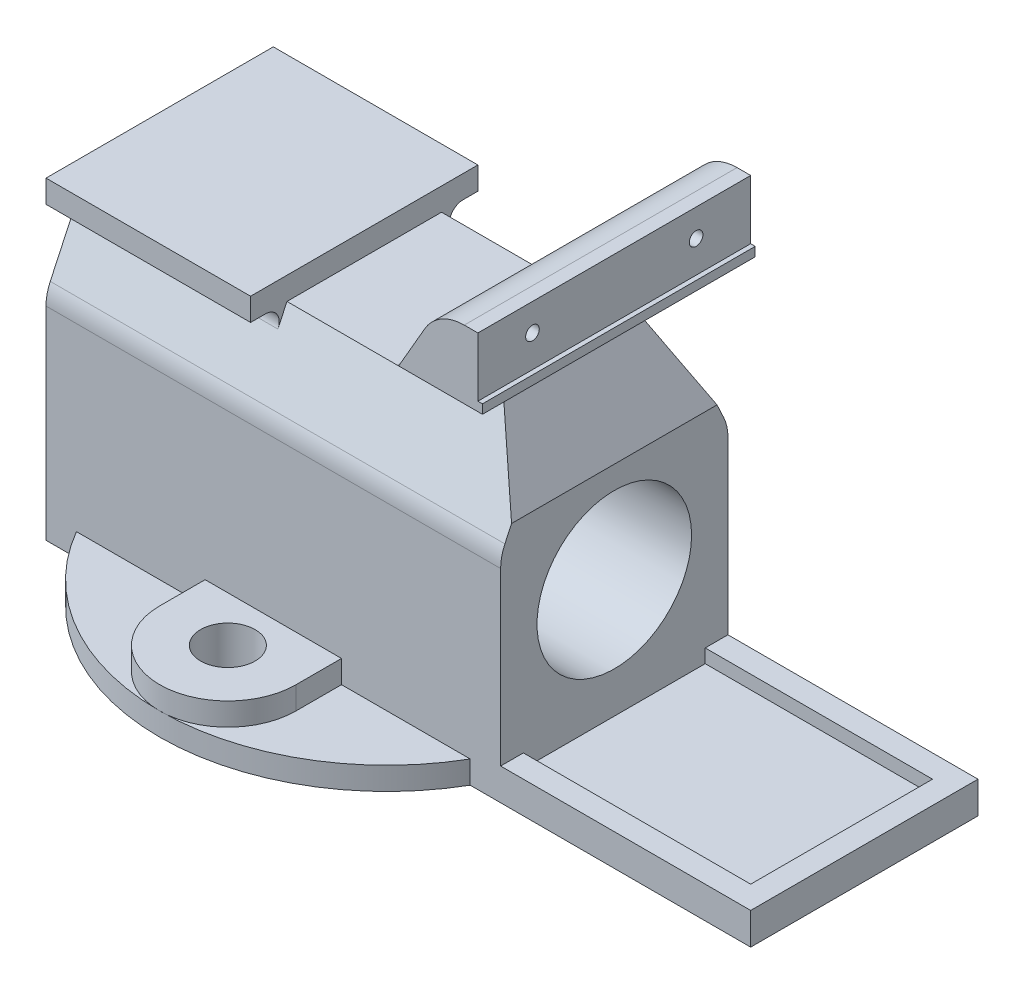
ISO-10303-21;
HEADER;
FILE_DESCRIPTION(('STEP AP214'),'2;1');
FILE_NAME('part.step','',(''),(''),'','','');
FILE_SCHEMA(('AUTOMOTIVE_DESIGN { 1 0 10303 214 1 1 1 1 }'));
ENDSEC;
DATA;
#1=APPLICATION_CONTEXT('core data for automotive mechanical design processes');
#2=APPLICATION_PROTOCOL_DEFINITION('international standard','automotive_design',2000,#1);
#3=PRODUCT_CONTEXT('',#1,'mechanical');
#4=PRODUCT('Part','Part','',(#3));
#5=PRODUCT_RELATED_PRODUCT_CATEGORY('part','',(#4));
#6=PRODUCT_DEFINITION_FORMATION('','',#4);
#7=PRODUCT_DEFINITION_CONTEXT('part definition',#1,'design');
#8=PRODUCT_DEFINITION('design','',#6,#7);
#9=PRODUCT_DEFINITION_SHAPE('','',#8);
#10=(LENGTH_UNIT() NAMED_UNIT(*) SI_UNIT(.MILLI.,.METRE.));
#11=(NAMED_UNIT(*) PLANE_ANGLE_UNIT() SI_UNIT($,.RADIAN.));
#12=(NAMED_UNIT(*) SI_UNIT($,.STERADIAN.) SOLID_ANGLE_UNIT());
#13=UNCERTAINTY_MEASURE_WITH_UNIT(LENGTH_MEASURE(1.E-05),#10,'distance_accuracy_value','');
#14=(GEOMETRIC_REPRESENTATION_CONTEXT(3) GLOBAL_UNCERTAINTY_ASSIGNED_CONTEXT((#13)) GLOBAL_UNIT_ASSIGNED_CONTEXT((#10,
#11,#12)) REPRESENTATION_CONTEXT('',''));
#15=CARTESIAN_POINT('',(0.,0.,0.));
#16=DIRECTION('',(0.,0.,1.));
#17=DIRECTION('',(1.,0.,0.));
#18=AXIS2_PLACEMENT_3D('',#15,#16,#17);
#19=CARTESIAN_POINT('',(50.,44.6269980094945,15.));
#20=DIRECTION('',(1.,0.,0.));
#21=DIRECTION('',(0.,0.,-1.));
#22=AXIS2_PLACEMENT_3D('',#19,#20,#21);
#23=PLANE('',#22);
#24=CARTESIAN_POINT('',(50.,85.9999999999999,18.));
#25=DIRECTION('',(1.,0.,0.));
#26=DIRECTION('',(0.,0.,-1.));
#27=AXIS2_PLACEMENT_3D('',#24,#25,#26);
#28=CIRCLE('',#27,1.5);
#29=CARTESIAN_POINT('',(50.,85.9999999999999,16.5));
#30=VERTEX_POINT('',#29);
#31=EDGE_CURVE('E394',#30,#30,#28,.T.);
#32=ORIENTED_EDGE('',*,*,#31,.F.);
#33=EDGE_LOOP('',(#32));
#34=FACE_BOUND('',#33,.T.);
#35=CARTESIAN_POINT('',(50.,85.9999999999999,-18.));
#36=DIRECTION('',(1.,0.,0.));
#37=DIRECTION('',(0.,0.,1.));
#38=AXIS2_PLACEMENT_3D('',#35,#36,#37);
#39=CIRCLE('',#38,1.5);
#40=CARTESIAN_POINT('',(50.,85.9999999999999,-16.5));
#41=VERTEX_POINT('',#40);
#42=EDGE_CURVE('E386',#41,#41,#39,.T.);
#43=ORIENTED_EDGE('',*,*,#42,.F.);
#44=EDGE_LOOP('',(#43));
#45=FACE_BOUND('',#44,.T.);
#46=DIRECTION('',(0.,0.,1.));
#47=VECTOR('',#46,1.);
#48=CARTESIAN_POINT('',(50.,78.9999999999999,30.));
#49=LINE('',#48,#47);
#50=CARTESIAN_POINT('',(50.,78.9999999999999,-30.));
#51=VERTEX_POINT('',#50);
#52=CARTESIAN_POINT('',(50.,78.9999999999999,30.));
#53=VERTEX_POINT('',#52);
#54=EDGE_CURVE('E405',#51,#53,#49,.T.);
#55=ORIENTED_EDGE('',*,*,#54,.F.);
#56=DIRECTION('',(0.,1.,0.));
#57=VECTOR('',#56,1.);
#58=CARTESIAN_POINT('',(50.,63.9999999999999,-30.));
#59=LINE('',#58,#57);
#60=CARTESIAN_POINT('',(50.,91.9999999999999,-30.));
#61=VERTEX_POINT('',#60);
#62=EDGE_CURVE('E509',#51,#61,#59,.T.);
#63=ORIENTED_EDGE('',*,*,#62,.T.);
#64=DIRECTION('',(0.,0.,-1.));
#65=VECTOR('',#64,1.);
#66=CARTESIAN_POINT('',(50.,91.9999999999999,30.));
#67=LINE('',#66,#65);
#68=CARTESIAN_POINT('',(50.,91.9999999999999,30.));
#69=VERTEX_POINT('',#68);
#70=EDGE_CURVE('E533',#69,#61,#67,.T.);
#71=ORIENTED_EDGE('',*,*,#70,.F.);
#72=DIRECTION('',(0.,1.,0.));
#73=VECTOR('',#72,1.);
#74=CARTESIAN_POINT('',(50.,63.9999999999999,30.));
#75=LINE('',#74,#73);
#76=EDGE_CURVE('E510',#53,#69,#75,.T.);
#77=ORIENTED_EDGE('',*,*,#76,.F.);
#78=EDGE_LOOP('',(#55,#63,#71,#77));
#79=FACE_BOUND('',#78,.T.);
#80=ADVANCED_FACE('F32',(#34,#45,#79),#23,.T.);
#81=CARTESIAN_POINT('',(50.,63.9999999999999,-17.));
#82=DIRECTION('',(0.,-1.,0.));
#83=DIRECTION('',(0.,0.,-1.));
#84=AXIS2_PLACEMENT_3D('',#81,#82,#83);
#85=PLANE('',#84);
#86=DIRECTION('',(-1.,0.,0.));
#87=VECTOR('',#86,1.);
#88=CARTESIAN_POINT('',(50.,63.9999999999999,17.));
#89=LINE('',#88,#87);
#90=CARTESIAN_POINT('',(19.287187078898,63.9999999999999,17.));
#91=VERTEX_POINT('',#90);
#92=CARTESIAN_POINT('',(-5.,63.9999999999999,17.));
#93=VERTEX_POINT('',#92);
#94=EDGE_CURVE('E652',#91,#93,#89,.T.);
#95=ORIENTED_EDGE('',*,*,#94,.F.);
#96=DIRECTION('',(0.,0.,-1.));
#97=VECTOR('',#96,1.);
#98=CARTESIAN_POINT('',(19.287187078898,63.9999999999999,-17.));
#99=LINE('',#98,#97);
#100=CARTESIAN_POINT('',(19.287187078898,63.9999999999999,-17.));
#101=VERTEX_POINT('',#100);
#102=EDGE_CURVE('E771',#91,#101,#99,.T.);
#103=ORIENTED_EDGE('',*,*,#102,.T.);
#104=DIRECTION('',(-1.,0.,0.));
#105=VECTOR('',#104,1.);
#106=CARTESIAN_POINT('',(50.,63.9999999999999,-17.));
#107=LINE('',#106,#105);
#108=CARTESIAN_POINT('',(-5.,63.9999999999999,-17.));
#109=VERTEX_POINT('',#108);
#110=EDGE_CURVE('E654',#101,#109,#107,.T.);
#111=ORIENTED_EDGE('',*,*,#110,.T.);
#112=DIRECTION('',(0.,0.,-1.));
#113=VECTOR('',#112,1.);
#114=CARTESIAN_POINT('',(-5.,63.9999999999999,-17.));
#115=LINE('',#114,#113);
#116=EDGE_CURVE('E556',#93,#109,#115,.T.);
#117=ORIENTED_EDGE('',*,*,#116,.F.);
#118=EDGE_LOOP('',(#95,#103,#111,#117));
#119=FACE_BOUND('',#118,.T.);
#120=ADVANCED_FACE('F832',(#119),#85,.F.);
#121=CARTESIAN_POINT('',(50.,48.8531806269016,-24.0630778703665));
#122=DIRECTION('',(0.,-0.42261826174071,0.906307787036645));
#123=DIRECTION('',(0.,-0.906307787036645,-0.42261826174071));
#124=AXIS2_PLACEMENT_3D('',#121,#122,#123);
#125=PLANE('',#124);
#126=ORIENTED_EDGE('',*,*,#110,.F.);
#127=CARTESIAN_POINT('',(19.287187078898,73.9999999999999,-12.3369234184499));
#128=DIRECTION('',(0.,-0.42261826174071,0.906307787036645));
#129=DIRECTION('',(0.,0.906307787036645,0.42261826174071));
#130=AXIS2_PLACEMENT_3D('',#127,#128,#129);
#131=ELLIPSE('',#130,11.033779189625,10.);
#132=CARTESIAN_POINT('',(26.4692253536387,67.0416721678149,-15.5816449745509));
#133=VERTEX_POINT('',#132);
#134=EDGE_CURVE('E464',#101,#133,#131,.T.);
#135=ORIENTED_EDGE('',*,*,#134,.T.);
#136=DIRECTION('',(1.,0.,0.));
#137=VECTOR('',#136,1.);
#138=CARTESIAN_POINT('',(-50.001,67.0416721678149,-15.5816449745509));
#139=LINE('',#138,#137);
#140=CARTESIAN_POINT('',(41.31568652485,67.0416721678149,-15.5816449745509));
#141=VERTEX_POINT('',#140);
#142=EDGE_CURVE('E55',#133,#141,#139,.T.);
#143=ORIENTED_EDGE('',*,*,#142,.T.);
#144=DIRECTION('',(0.463622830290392,-0.803018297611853,-0.374453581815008));
#145=VECTOR('',#144,1.);
#146=CARTESIAN_POINT('',(51.4262992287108,49.5295772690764,-23.74766893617));
#147=LINE('',#146,#145);
#148=CARTESIAN_POINT('',(50.,51.9999999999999,-22.5956918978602));
#149=VERTEX_POINT('',#148);
#150=EDGE_CURVE('E499',#141,#149,#147,.T.);
#151=ORIENTED_EDGE('',*,*,#150,.T.);
#152=DIRECTION('',(0.,0.906307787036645,0.42261826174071));
#153=VECTOR('',#152,1.);
#154=CARTESIAN_POINT('',(50.,48.8531806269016,-24.0630778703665));
#155=LINE('',#154,#153);
#156=CARTESIAN_POINT('',(50.,48.8531806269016,-24.0630778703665));
#157=VERTEX_POINT('',#156);
#158=EDGE_CURVE('E630',#157,#149,#155,.T.);
#159=ORIENTED_EDGE('',*,*,#158,.F.);
#160=DIRECTION('',(-1.,0.,0.));
#161=VECTOR('',#160,1.);
#162=CARTESIAN_POINT('',(50.,48.8531806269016,-24.0630778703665));
#163=LINE('',#162,#161);
#164=CARTESIAN_POINT('',(-50.,48.8531806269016,-24.0630778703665));
#165=VERTEX_POINT('',#164);
#166=EDGE_CURVE('E656',#157,#165,#163,.T.);
#167=ORIENTED_EDGE('',*,*,#166,.T.);
#168=DIRECTION('',(0.,0.906307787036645,0.42261826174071));
#169=VECTOR('',#168,1.);
#170=CARTESIAN_POINT('',(-50.,48.8531806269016,-24.0630778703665));
#171=LINE('',#170,#169);
#172=CARTESIAN_POINT('',(-50.,59.7321452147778,-18.9901333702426));
#173=VERTEX_POINT('',#172);
#174=EDGE_CURVE('E647',#165,#173,#171,.T.);
#175=ORIENTED_EDGE('',*,*,#174,.T.);
#176=DIRECTION('',(-1.,0.,0.));
#177=VECTOR('',#176,1.);
#178=CARTESIAN_POINT('',(-5.,59.7321452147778,-18.9901333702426));
#179=LINE('',#178,#177);
#180=CARTESIAN_POINT('',(-5.,59.7321452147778,-18.9901333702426));
#181=VERTEX_POINT('',#180);
#182=EDGE_CURVE('E615',#181,#173,#179,.T.);
#183=ORIENTED_EDGE('',*,*,#182,.F.);
#184=DIRECTION('',(0.,-0.906307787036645,-0.42261826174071));
#185=VECTOR('',#184,1.);
#186=CARTESIAN_POINT('',(-5.,59.7321452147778,-18.9901333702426));
#187=LINE('',#186,#185);
#188=EDGE_CURVE('E559',#109,#181,#187,.T.);
#189=ORIENTED_EDGE('',*,*,#188,.F.);
#190=EDGE_LOOP('',(#126,#135,#143,#151,#159,#167,#175,#183,#189));
#191=FACE_BOUND('',#190,.T.);
#192=ADVANCED_FACE('F781',(#191),#125,.F.);
#193=CARTESIAN_POINT('',(0.,5.,0.));
#194=DIRECTION('',(0.,1.,0.));
#195=DIRECTION('',(0.,0.,1.));
#196=AXIS2_PLACEMENT_3D('',#193,#194,#195);
#197=PLANE('',#196);
#198=DIRECTION('',(0.,0.,-1.));
#199=VECTOR('',#198,1.);
#200=CARTESIAN_POINT('',(-15.,5.,-35.));
#201=LINE('',#200,#199);
#202=CARTESIAN_POINT('',(-15.,5.,35.));
#203=VERTEX_POINT('',#202);
#204=CARTESIAN_POINT('',(-15.,5.,25.));
#205=VERTEX_POINT('',#204);
#206=EDGE_CURVE('E719',#203,#205,#201,.T.);
#207=ORIENTED_EDGE('',*,*,#206,.T.);
#208=DIRECTION('',(-1.,0.,0.));
#209=VECTOR('',#208,1.);
#210=CARTESIAN_POINT('',(0.,5.,25.));
#211=LINE('',#210,#209);
#212=CARTESIAN_POINT('',(-43.3012701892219,5.,25.));
#213=VERTEX_POINT('',#212);
#214=EDGE_CURVE('E694',#205,#213,#211,.T.);
#215=ORIENTED_EDGE('',*,*,#214,.T.);
#216=CARTESIAN_POINT('',(0.,5.,0.));
#217=DIRECTION('',(0.,1.,0.));
#218=DIRECTION('',(0.,0.,1.));
#219=AXIS2_PLACEMENT_3D('',#216,#217,#218);
#220=CIRCLE('',#219,50.);
#221=CARTESIAN_POINT('',(0.,5.,50.));
#222=VERTEX_POINT('',#221);
#223=EDGE_CURVE('E759',#213,#222,#220,.T.);
#224=ORIENTED_EDGE('',*,*,#223,.T.);
#225=CARTESIAN_POINT('',(0.,5.,35.));
#226=DIRECTION('',(0.,-1.,0.));
#227=DIRECTION('',(0.,0.,-1.));
#228=AXIS2_PLACEMENT_3D('',#225,#226,#227);
#229=CIRCLE('',#228,15.);
#230=EDGE_CURVE('E742',#222,#203,#229,.T.);
#231=ORIENTED_EDGE('',*,*,#230,.T.);
#232=EDGE_LOOP('',(#207,#215,#224,#231));
#233=FACE_BOUND('',#232,.T.);
#234=ADVANCED_FACE('F1048',(#233),#197,.T.);
#235=CARTESIAN_POINT('',(0.,5.,-50.));
#236=VERTEX_POINT('',#235);
#237=CARTESIAN_POINT('',(-43.3012701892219,5.,-25.));
#238=VERTEX_POINT('',#237);
#239=EDGE_CURVE('E760',#236,#238,#220,.T.);
#240=ORIENTED_EDGE('',*,*,#239,.T.);
#241=DIRECTION('',(1.,0.,0.));
#242=VECTOR('',#241,1.);
#243=CARTESIAN_POINT('',(0.,5.,-25.));
#244=LINE('',#243,#242);
#245=CARTESIAN_POINT('',(-15.,5.,-25.));
#246=VERTEX_POINT('',#245);
#247=EDGE_CURVE('E680',#238,#246,#244,.T.);
#248=ORIENTED_EDGE('',*,*,#247,.T.);
#249=CARTESIAN_POINT('',(-15.,5.,-35.));
#250=VERTEX_POINT('',#249);
#251=EDGE_CURVE('E741',#246,#250,#201,.T.);
#252=ORIENTED_EDGE('',*,*,#251,.T.);
#253=CARTESIAN_POINT('',(0.,5.,-35.));
#254=DIRECTION('',(0.,-1.,0.));
#255=DIRECTION('',(0.,0.,-1.));
#256=AXIS2_PLACEMENT_3D('',#253,#254,#255);
#257=CIRCLE('',#256,15.);
#258=EDGE_CURVE('E706',#250,#236,#257,.T.);
#259=ORIENTED_EDGE('',*,*,#258,.T.);
#260=EDGE_LOOP('',(#240,#248,#252,#259));
#261=FACE_BOUND('',#260,.T.);
#262=ADVANCED_FACE('F1352',(#261),#197,.T.);
#263=CARTESIAN_POINT('',(43.3012701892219,5.,25.));
#264=VERTEX_POINT('',#263);
#265=EDGE_CURVE('E755',#222,#264,#220,.T.);
#266=ORIENTED_EDGE('',*,*,#265,.T.);
#267=DIRECTION('',(-1.,0.,0.));
#268=VECTOR('',#267,1.);
#269=CARTESIAN_POINT('',(0.,5.,25.));
#270=LINE('',#269,#268);
#271=CARTESIAN_POINT('',(15.,5.,25.));
#272=VERTEX_POINT('',#271);
#273=EDGE_CURVE('E692',#264,#272,#270,.T.);
#274=ORIENTED_EDGE('',*,*,#273,.T.);
#275=DIRECTION('',(0.,0.,1.));
#276=VECTOR('',#275,1.);
#277=CARTESIAN_POINT('',(15.,5.,-35.));
#278=LINE('',#277,#276);
#279=CARTESIAN_POINT('',(15.,5.,35.));
#280=VERTEX_POINT('',#279);
#281=EDGE_CURVE('E733',#272,#280,#278,.T.);
#282=ORIENTED_EDGE('',*,*,#281,.T.);
#283=EDGE_CURVE('E738',#280,#222,#229,.T.);
#284=ORIENTED_EDGE('',*,*,#283,.T.);
#285=EDGE_LOOP('',(#266,#274,#282,#284));
#286=FACE_BOUND('',#285,.T.);
#287=ADVANCED_FACE('F1363',(#286),#197,.T.);
#288=CARTESIAN_POINT('',(15.,5.,-35.));
#289=VERTEX_POINT('',#288);
#290=CARTESIAN_POINT('',(15.,5.,-25.));
#291=VERTEX_POINT('',#290);
#292=EDGE_CURVE('E735',#289,#291,#278,.T.);
#293=ORIENTED_EDGE('',*,*,#292,.T.);
#294=DIRECTION('',(1.,0.,0.));
#295=VECTOR('',#294,1.);
#296=CARTESIAN_POINT('',(0.,5.,-25.));
#297=LINE('',#296,#295);
#298=CARTESIAN_POINT('',(43.3012701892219,5.,-25.));
#299=VERTEX_POINT('',#298);
#300=EDGE_CURVE('E678',#291,#299,#297,.T.);
#301=ORIENTED_EDGE('',*,*,#300,.T.);
#302=EDGE_CURVE('E758',#299,#236,#220,.T.);
#303=ORIENTED_EDGE('',*,*,#302,.T.);
#304=EDGE_CURVE('E734',#236,#289,#257,.T.);
#305=ORIENTED_EDGE('',*,*,#304,.T.);
#306=EDGE_LOOP('',(#293,#301,#303,#305));
#307=FACE_BOUND('',#306,.T.);
#308=ADVANCED_FACE('F1355',(#307),#197,.T.);
#309=CARTESIAN_POINT('',(0.,5.,0.));
#310=DIRECTION('',(0.,-1.,0.));
#311=DIRECTION('',(0.,0.,-1.));
#312=AXIS2_PLACEMENT_3D('',#309,#310,#311);
#313=CYLINDRICAL_SURFACE('',#312,50.);
#314=DIRECTION('',(0.,-1.,0.));
#315=VECTOR('',#314,1.);
#316=CARTESIAN_POINT('',(43.3012701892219,5.,25.));
#317=LINE('',#316,#315);
#318=CARTESIAN_POINT('',(43.3012701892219,0.,25.));
#319=VERTEX_POINT('',#318);
#320=EDGE_CURVE('E699',#264,#319,#317,.T.);
#321=ORIENTED_EDGE('',*,*,#320,.F.);
#322=ORIENTED_EDGE('',*,*,#265,.F.);
#323=ORIENTED_EDGE('',*,*,#223,.F.);
#324=DIRECTION('',(0.,-1.,0.));
#325=VECTOR('',#324,1.);
#326=CARTESIAN_POINT('',(-43.3012701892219,5.,25.));
#327=LINE('',#326,#325);
#328=CARTESIAN_POINT('',(-43.3012701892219,0.,25.));
#329=VERTEX_POINT('',#328);
#330=EDGE_CURVE('E696',#329,#213,#327,.F.);
#331=ORIENTED_EDGE('',*,*,#330,.F.);
#332=CARTESIAN_POINT('',(0.,0.,0.));
#333=DIRECTION('',(0.,1.,0.));
#334=DIRECTION('',(0.,0.,1.));
#335=AXIS2_PLACEMENT_3D('',#332,#333,#334);
#336=CIRCLE('',#335,50.);
#337=EDGE_CURVE('E748',#329,#319,#336,.T.);
#338=ORIENTED_EDGE('',*,*,#337,.T.);
#339=EDGE_LOOP('',(#321,#322,#323,#331,#338));
#340=FACE_BOUND('',#339,.T.);
#341=ADVANCED_FACE('F1378',(#340),#313,.T.);
#342=DIRECTION('',(0.,-1.,0.));
#343=VECTOR('',#342,1.);
#344=CARTESIAN_POINT('',(-43.3012701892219,5.,-25.));
#345=LINE('',#344,#343);
#346=CARTESIAN_POINT('',(-43.3012701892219,0.,-25.));
#347=VERTEX_POINT('',#346);
#348=EDGE_CURVE('E685',#238,#347,#345,.T.);
#349=ORIENTED_EDGE('',*,*,#348,.F.);
#350=ORIENTED_EDGE('',*,*,#239,.F.);
#351=ORIENTED_EDGE('',*,*,#302,.F.);
#352=DIRECTION('',(0.,-1.,0.));
#353=VECTOR('',#352,1.);
#354=CARTESIAN_POINT('',(43.3012701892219,5.,-25.));
#355=LINE('',#354,#353);
#356=CARTESIAN_POINT('',(43.3012701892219,0.,-25.));
#357=VERTEX_POINT('',#356);
#358=EDGE_CURVE('E682',#357,#299,#355,.F.);
#359=ORIENTED_EDGE('',*,*,#358,.F.);
#360=EDGE_CURVE('E762',#357,#347,#336,.T.);
#361=ORIENTED_EDGE('',*,*,#360,.T.);
#362=EDGE_LOOP('',(#349,#350,#351,#359,#361));
#363=FACE_BOUND('',#362,.T.);
#364=ADVANCED_FACE('F1386',(#363),#313,.T.);
#365=CARTESIAN_POINT('',(-15.,10.,-35.));
#366=DIRECTION('',(-1.,0.,0.));
#367=DIRECTION('',(0.,0.,1.));
#368=AXIS2_PLACEMENT_3D('',#365,#366,#367);
#369=PLANE('',#368);
#370=DIRECTION('',(0.,0.,-1.));
#371=VECTOR('',#370,1.);
#372=CARTESIAN_POINT('',(-15.,10.,-35.));
#373=LINE('',#372,#371);
#374=CARTESIAN_POINT('',(-15.,10.,35.));
#375=VERTEX_POINT('',#374);
#376=CARTESIAN_POINT('',(-15.,10.,25.));
#377=VERTEX_POINT('',#376);
#378=EDGE_CURVE('E727',#375,#377,#373,.T.);
#379=ORIENTED_EDGE('',*,*,#378,.T.);
#380=DIRECTION('',(0.,-1.,0.));
#381=VECTOR('',#380,1.);
#382=CARTESIAN_POINT('',(-15.,9.99999999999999,25.));
#383=LINE('',#382,#381);
#384=EDGE_CURVE('E690',#377,#205,#383,.T.);
#385=ORIENTED_EDGE('',*,*,#384,.T.);
#386=ORIENTED_EDGE('',*,*,#206,.F.);
#387=DIRECTION('',(0.,-1.,0.));
#388=VECTOR('',#387,1.);
#389=CARTESIAN_POINT('',(-15.,10.,35.));
#390=LINE('',#389,#388);
#391=EDGE_CURVE('E749',#375,#203,#390,.T.);
#392=ORIENTED_EDGE('',*,*,#391,.F.);
#393=EDGE_LOOP('',(#379,#385,#386,#392));
#394=FACE_BOUND('',#393,.T.);
#395=ADVANCED_FACE('F1394',(#394),#369,.T.);
#396=ORIENTED_EDGE('',*,*,#251,.F.);
#397=DIRECTION('',(0.,1.,0.));
#398=VECTOR('',#397,1.);
#399=CARTESIAN_POINT('',(-15.,10.,-25.));
#400=LINE('',#399,#398);
#401=CARTESIAN_POINT('',(-15.,10.,-25.));
#402=VERTEX_POINT('',#401);
#403=EDGE_CURVE('E675',#246,#402,#400,.T.);
#404=ORIENTED_EDGE('',*,*,#403,.T.);
#405=CARTESIAN_POINT('',(-15.,10.,-35.));
#406=VERTEX_POINT('',#405);
#407=EDGE_CURVE('E726',#402,#406,#373,.T.);
#408=ORIENTED_EDGE('',*,*,#407,.T.);
#409=DIRECTION('',(0.,-1.,0.));
#410=VECTOR('',#409,1.);
#411=CARTESIAN_POINT('',(-15.,10.,-35.));
#412=LINE('',#411,#410);
#413=EDGE_CURVE('E745',#406,#250,#412,.T.);
#414=ORIENTED_EDGE('',*,*,#413,.T.);
#415=EDGE_LOOP('',(#396,#404,#408,#414));
#416=FACE_BOUND('',#415,.T.);
#417=ADVANCED_FACE('F1402',(#416),#369,.T.);
#418=CARTESIAN_POINT('',(15.,10.,-35.));
#419=DIRECTION('',(1.,0.,0.));
#420=DIRECTION('',(0.,0.,-1.));
#421=AXIS2_PLACEMENT_3D('',#418,#419,#420);
#422=PLANE('',#421);
#423=ORIENTED_EDGE('',*,*,#281,.F.);
#424=DIRECTION('',(0.,1.,0.));
#425=VECTOR('',#424,1.);
#426=CARTESIAN_POINT('',(15.,9.99999999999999,25.));
#427=LINE('',#426,#425);
#428=CARTESIAN_POINT('',(15.,10.,25.));
#429=VERTEX_POINT('',#428);
#430=EDGE_CURVE('E688',#272,#429,#427,.T.);
#431=ORIENTED_EDGE('',*,*,#430,.T.);
#432=DIRECTION('',(0.,0.,1.));
#433=VECTOR('',#432,1.);
#434=CARTESIAN_POINT('',(15.,10.,-35.));
#435=LINE('',#434,#433);
#436=CARTESIAN_POINT('',(15.,10.,35.));
#437=VERTEX_POINT('',#436);
#438=EDGE_CURVE('E718',#429,#437,#435,.T.);
#439=ORIENTED_EDGE('',*,*,#438,.T.);
#440=DIRECTION('',(0.,-1.,0.));
#441=VECTOR('',#440,1.);
#442=CARTESIAN_POINT('',(15.,10.,35.));
#443=LINE('',#442,#441);
#444=EDGE_CURVE('E751',#437,#280,#443,.T.);
#445=ORIENTED_EDGE('',*,*,#444,.T.);
#446=EDGE_LOOP('',(#423,#431,#439,#445));
#447=FACE_BOUND('',#446,.T.);
#448=ADVANCED_FACE('F1411',(#447),#422,.T.);
#449=CARTESIAN_POINT('',(15.,10.,-35.));
#450=VERTEX_POINT('',#449);
#451=CARTESIAN_POINT('',(15.,10.,-25.));
#452=VERTEX_POINT('',#451);
#453=EDGE_CURVE('E720',#450,#452,#435,.T.);
#454=ORIENTED_EDGE('',*,*,#453,.T.);
#455=DIRECTION('',(0.,-1.,0.));
#456=VECTOR('',#455,1.);
#457=CARTESIAN_POINT('',(15.,10.,-25.));
#458=LINE('',#457,#456);
#459=EDGE_CURVE('E673',#452,#291,#458,.T.);
#460=ORIENTED_EDGE('',*,*,#459,.T.);
#461=ORIENTED_EDGE('',*,*,#292,.F.);
#462=DIRECTION('',(0.,-1.,0.));
#463=VECTOR('',#462,1.);
#464=CARTESIAN_POINT('',(15.,10.,-35.));
#465=LINE('',#464,#463);
#466=EDGE_CURVE('E730',#450,#289,#465,.T.);
#467=ORIENTED_EDGE('',*,*,#466,.F.);
#468=EDGE_LOOP('',(#454,#460,#461,#467));
#469=FACE_BOUND('',#468,.T.);
#470=ADVANCED_FACE('F1419',(#469),#422,.T.);
#471=CARTESIAN_POINT('',(0.,10.,-35.));
#472=DIRECTION('',(0.,-1.,0.));
#473=DIRECTION('',(0.,0.,-1.));
#474=AXIS2_PLACEMENT_3D('',#471,#472,#473);
#475=PLANE('',#474);
#476=CARTESIAN_POINT('',(0.,10.,35.));
#477=DIRECTION('',(0.,1.,0.));
#478=DIRECTION('',(0.,0.,1.));
#479=AXIS2_PLACEMENT_3D('',#476,#477,#478);
#480=CIRCLE('',#479,6.);
#481=CARTESIAN_POINT('',(0.,10.,41.));
#482=VERTEX_POINT('',#481);
#483=EDGE_CURVE('E702',#482,#482,#480,.T.);
#484=ORIENTED_EDGE('',*,*,#483,.F.);
#485=EDGE_LOOP('',(#484));
#486=FACE_BOUND('',#485,.T.);
#487=DIRECTION('',(1.,0.,0.));
#488=VECTOR('',#487,1.);
#489=CARTESIAN_POINT('',(0.,10.,25.));
#490=LINE('',#489,#488);
#491=EDGE_CURVE('E766',#377,#429,#490,.T.);
#492=ORIENTED_EDGE('',*,*,#491,.F.);
#493=ORIENTED_EDGE('',*,*,#378,.F.);
#494=CARTESIAN_POINT('',(0.,10.,35.));
#495=DIRECTION('',(0.,-1.,0.));
#496=DIRECTION('',(0.,0.,-1.));
#497=AXIS2_PLACEMENT_3D('',#494,#495,#496);
#498=CIRCLE('',#497,15.);
#499=EDGE_CURVE('E723',#437,#375,#498,.T.);
#500=ORIENTED_EDGE('',*,*,#499,.F.);
#501=ORIENTED_EDGE('',*,*,#438,.F.);
#502=EDGE_LOOP('',(#492,#493,#500,#501));
#503=FACE_BOUND('',#502,.T.);
#504=ADVANCED_FACE('F1428',(#486,#503),#475,.F.);
#505=CARTESIAN_POINT('',(0.,10.,-35.));
#506=DIRECTION('',(0.,1.,0.));
#507=DIRECTION('',(0.,0.,1.));
#508=AXIS2_PLACEMENT_3D('',#505,#506,#507);
#509=CIRCLE('',#508,6.);
#510=CARTESIAN_POINT('',(0.,10.,-29.));
#511=VERTEX_POINT('',#510);
#512=EDGE_CURVE('E707',#511,#511,#509,.T.);
#513=ORIENTED_EDGE('',*,*,#512,.F.);
#514=EDGE_LOOP('',(#513));
#515=FACE_BOUND('',#514,.T.);
#516=DIRECTION('',(-1.,0.,0.));
#517=VECTOR('',#516,1.);
#518=CARTESIAN_POINT('',(0.,10.,-25.));
#519=LINE('',#518,#517);
#520=EDGE_CURVE('E763',#452,#402,#519,.T.);
#521=ORIENTED_EDGE('',*,*,#520,.F.);
#522=ORIENTED_EDGE('',*,*,#453,.F.);
#523=CARTESIAN_POINT('',(0.,10.,-35.));
#524=DIRECTION('',(0.,-1.,0.));
#525=DIRECTION('',(0.,0.,-1.));
#526=AXIS2_PLACEMENT_3D('',#523,#524,#525);
#527=CIRCLE('',#526,15.);
#528=EDGE_CURVE('E715',#406,#450,#527,.T.);
#529=ORIENTED_EDGE('',*,*,#528,.F.);
#530=ORIENTED_EDGE('',*,*,#407,.F.);
#531=EDGE_LOOP('',(#521,#522,#529,#530));
#532=FACE_BOUND('',#531,.T.);
#533=ADVANCED_FACE('F1220',(#515,#532),#475,.F.);
#534=CARTESIAN_POINT('',(0.,0.,0.));
#535=DIRECTION('',(0.,1.,0.));
#536=DIRECTION('',(0.,0.,1.));
#537=AXIS2_PLACEMENT_3D('',#534,#535,#536);
#538=PLANE('',#537);
#539=DIRECTION('',(-1.,0.,0.));
#540=VECTOR('',#539,1.);
#541=CARTESIAN_POINT('',(50.,0.,-25.));
#542=LINE('',#541,#540);
#543=CARTESIAN_POINT('',(105.,0.,-25.));
#544=VERTEX_POINT('',#543);
#545=EDGE_CURVE('E663',#544,#357,#542,.T.);
#546=ORIENTED_EDGE('',*,*,#545,.F.);
#547=DIRECTION('',(0.,0.,1.));
#548=VECTOR('',#547,1.);
#549=CARTESIAN_POINT('',(105.,0.,-80.4436651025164));
#550=LINE('',#549,#548);
#551=CARTESIAN_POINT('',(105.,0.,25.));
#552=VERTEX_POINT('',#551);
#553=EDGE_CURVE('E546',#544,#552,#550,.T.);
#554=ORIENTED_EDGE('',*,*,#553,.T.);
#555=DIRECTION('',(-1.,0.,0.));
#556=VECTOR('',#555,1.);
#557=CARTESIAN_POINT('',(50.,0.,25.));
#558=LINE('',#557,#556);
#559=EDGE_CURVE('E667',#552,#319,#558,.T.);
#560=ORIENTED_EDGE('',*,*,#559,.T.);
#561=ORIENTED_EDGE('',*,*,#337,.F.);
#562=CARTESIAN_POINT('',(-50.,0.,25.));
#563=VERTEX_POINT('',#562);
#564=EDGE_CURVE('E666',#329,#563,#558,.T.);
#565=ORIENTED_EDGE('',*,*,#564,.T.);
#566=DIRECTION('',(0.,0.,-1.));
#567=VECTOR('',#566,1.);
#568=CARTESIAN_POINT('',(-50.,0.,25.));
#569=LINE('',#568,#567);
#570=CARTESIAN_POINT('',(-50.,0.,-25.));
#571=VERTEX_POINT('',#570);
#572=EDGE_CURVE('E641',#563,#571,#569,.T.);
#573=ORIENTED_EDGE('',*,*,#572,.T.);
#574=EDGE_CURVE('E662',#347,#571,#542,.T.);
#575=ORIENTED_EDGE('',*,*,#574,.F.);
#576=ORIENTED_EDGE('',*,*,#360,.F.);
#577=EDGE_LOOP('',(#546,#554,#560,#561,#565,#573,#575,#576));
#578=FACE_BOUND('',#577,.T.);
#579=CARTESIAN_POINT('',(0.,0.,-35.));
#580=DIRECTION('',(0.,1.,0.));
#581=DIRECTION('',(0.,0.,1.));
#582=AXIS2_PLACEMENT_3D('',#579,#580,#581);
#583=CIRCLE('',#582,6.);
#584=CARTESIAN_POINT('',(0.,0.,-29.));
#585=VERTEX_POINT('',#584);
#586=EDGE_CURVE('E703',#585,#585,#583,.T.);
#587=ORIENTED_EDGE('',*,*,#586,.T.);
#588=EDGE_LOOP('',(#587));
#589=FACE_BOUND('',#588,.T.);
#590=CARTESIAN_POINT('',(0.,0.,35.));
#591=DIRECTION('',(0.,1.,0.));
#592=DIRECTION('',(0.,0.,1.));
#593=AXIS2_PLACEMENT_3D('',#590,#591,#592);
#594=CIRCLE('',#593,6.);
#595=CARTESIAN_POINT('',(0.,0.,41.));
#596=VERTEX_POINT('',#595);
#597=EDGE_CURVE('E710',#596,#596,#594,.T.);
#598=ORIENTED_EDGE('',*,*,#597,.T.);
#599=EDGE_LOOP('',(#598));
#600=FACE_BOUND('',#599,.T.);
#601=ADVANCED_FACE('F1215',(#578,#589,#600),#538,.F.);
#602=CARTESIAN_POINT('',(0.,10.,-35.));
#603=DIRECTION('',(0.,-1.,0.));
#604=DIRECTION('',(0.,0.,-1.));
#605=AXIS2_PLACEMENT_3D('',#602,#603,#604);
#606=CYLINDRICAL_SURFACE('',#605,15.);
#607=ORIENTED_EDGE('',*,*,#258,.F.);
#608=ORIENTED_EDGE('',*,*,#413,.F.);
#609=ORIENTED_EDGE('',*,*,#528,.T.);
#610=ORIENTED_EDGE('',*,*,#466,.T.);
#611=ORIENTED_EDGE('',*,*,#304,.F.);
#612=EDGE_LOOP('',(#607,#608,#609,#610,#611));
#613=FACE_BOUND('',#612,.T.);
#614=ADVANCED_FACE('F1219',(#613),#606,.T.);
#615=CARTESIAN_POINT('',(0.,10.,35.));
#616=DIRECTION('',(0.,-1.,0.));
#617=DIRECTION('',(0.,0.,-1.));
#618=AXIS2_PLACEMENT_3D('',#615,#616,#617);
#619=CYLINDRICAL_SURFACE('',#618,15.);
#620=ORIENTED_EDGE('',*,*,#283,.F.);
#621=ORIENTED_EDGE('',*,*,#444,.F.);
#622=ORIENTED_EDGE('',*,*,#499,.T.);
#623=ORIENTED_EDGE('',*,*,#391,.T.);
#624=ORIENTED_EDGE('',*,*,#230,.F.);
#625=EDGE_LOOP('',(#620,#621,#622,#623,#624));
#626=FACE_BOUND('',#625,.T.);
#627=ADVANCED_FACE('F1456',(#626),#619,.T.);
#628=CARTESIAN_POINT('',(0.,0.,35.));
#629=DIRECTION('',(0.,1.,0.));
#630=DIRECTION('',(0.,0.,1.));
#631=AXIS2_PLACEMENT_3D('',#628,#629,#630);
#632=CYLINDRICAL_SURFACE('',#631,6.);
#633=ORIENTED_EDGE('',*,*,#597,.F.);
#634=EDGE_LOOP('',(#633));
#635=FACE_BOUND('',#634,.T.);
#636=ORIENTED_EDGE('',*,*,#483,.T.);
#637=EDGE_LOOP('',(#636));
#638=FACE_BOUND('',#637,.T.);
#639=ADVANCED_FACE('F1447',(#635,#638),#632,.F.);
#640=CARTESIAN_POINT('',(0.,0.,-35.));
#641=DIRECTION('',(0.,1.,0.));
#642=DIRECTION('',(0.,0.,1.));
#643=AXIS2_PLACEMENT_3D('',#640,#641,#642);
#644=CYLINDRICAL_SURFACE('',#643,6.);
#645=ORIENTED_EDGE('',*,*,#586,.F.);
#646=EDGE_LOOP('',(#645));
#647=FACE_BOUND('',#646,.T.);
#648=ORIENTED_EDGE('',*,*,#512,.T.);
#649=EDGE_LOOP('',(#648));
#650=FACE_BOUND('',#649,.T.);
#651=ADVANCED_FACE('F1235',(#647,#650),#644,.F.);
#652=CARTESIAN_POINT('',(50.,44.6269980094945,25.));
#653=DIRECTION('',(0.,0.,-1.));
#654=DIRECTION('',(0.,1.,0.));
#655=AXIS2_PLACEMENT_3D('',#652,#653,#654);
#656=PLANE('',#655);
#657=ORIENTED_EDGE('',*,*,#273,.F.);
#658=ORIENTED_EDGE('',*,*,#320,.T.);
#659=ORIENTED_EDGE('',*,*,#559,.F.);
#660=DIRECTION('',(0.,1.,0.));
#661=VECTOR('',#660,1.);
#662=CARTESIAN_POINT('',(105.,0.,25.));
#663=LINE('',#662,#661);
#664=CARTESIAN_POINT('',(105.,7.,25.));
#665=VERTEX_POINT('',#664);
#666=EDGE_CURVE('E536',#552,#665,#663,.T.);
#667=ORIENTED_EDGE('',*,*,#666,.T.);
#668=DIRECTION('',(-1.,0.,0.));
#669=VECTOR('',#668,1.);
#670=CARTESIAN_POINT('',(105.,7.,25.));
#671=LINE('',#670,#669);
#672=CARTESIAN_POINT('',(50.,6.99999999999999,25.));
#673=VERTEX_POINT('',#672);
#674=EDGE_CURVE('E543',#665,#673,#671,.T.);
#675=ORIENTED_EDGE('',*,*,#674,.T.);
#676=DIRECTION('',(0.,-1.,0.));
#677=VECTOR('',#676,1.);
#678=CARTESIAN_POINT('',(50.,44.6269980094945,25.));
#679=LINE('',#678,#677);
#680=CARTESIAN_POINT('',(50.,44.6269980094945,25.));
#681=VERTEX_POINT('',#680);
#682=EDGE_CURVE('E622',#681,#673,#679,.T.);
#683=ORIENTED_EDGE('',*,*,#682,.F.);
#684=DIRECTION('',(-1.,0.,0.));
#685=VECTOR('',#684,1.);
#686=CARTESIAN_POINT('',(50.,44.6269980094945,25.));
#687=LINE('',#686,#685);
#688=CARTESIAN_POINT('',(-50.,44.6269980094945,25.));
#689=VERTEX_POINT('',#688);
#690=EDGE_CURVE('E670',#681,#689,#687,.T.);
#691=ORIENTED_EDGE('',*,*,#690,.T.);
#692=DIRECTION('',(0.,-1.,0.));
#693=VECTOR('',#692,1.);
#694=CARTESIAN_POINT('',(-50.,44.6269980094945,25.));
#695=LINE('',#694,#693);
#696=EDGE_CURVE('E638',#689,#563,#695,.T.);
#697=ORIENTED_EDGE('',*,*,#696,.T.);
#698=ORIENTED_EDGE('',*,*,#564,.F.);
#699=ORIENTED_EDGE('',*,*,#330,.T.);
#700=ORIENTED_EDGE('',*,*,#214,.F.);
#701=ORIENTED_EDGE('',*,*,#384,.F.);
#702=ORIENTED_EDGE('',*,*,#491,.T.);
#703=ORIENTED_EDGE('',*,*,#430,.F.);
#704=EDGE_LOOP('',(#657,#658,#659,#667,#675,#683,#691,#697,#698,#699,#700,#701,#702,#703));
#705=FACE_BOUND('',#704,.T.);
#706=ADVANCED_FACE('F1230',(#705),#656,.F.);
#707=CARTESIAN_POINT('',(50.,44.6269980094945,-25.));
#708=DIRECTION('',(0.,0.,1.));
#709=DIRECTION('',(0.,-1.,0.));
#710=AXIS2_PLACEMENT_3D('',#707,#708,#709);
#711=PLANE('',#710);
#712=ORIENTED_EDGE('',*,*,#247,.F.);
#713=ORIENTED_EDGE('',*,*,#348,.T.);
#714=ORIENTED_EDGE('',*,*,#574,.T.);
#715=DIRECTION('',(0.,1.,0.));
#716=VECTOR('',#715,1.);
#717=CARTESIAN_POINT('',(-50.,44.6269980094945,-25.));
#718=LINE('',#717,#716);
#719=CARTESIAN_POINT('',(-50.,44.6269980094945,-25.));
#720=VERTEX_POINT('',#719);
#721=EDGE_CURVE('E643',#571,#720,#718,.T.);
#722=ORIENTED_EDGE('',*,*,#721,.T.);
#723=DIRECTION('',(-1.,0.,0.));
#724=VECTOR('',#723,1.);
#725=CARTESIAN_POINT('',(50.,44.6269980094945,-25.));
#726=LINE('',#725,#724);
#727=CARTESIAN_POINT('',(50.,44.6269980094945,-25.));
#728=VERTEX_POINT('',#727);
#729=EDGE_CURVE('E659',#728,#720,#726,.T.);
#730=ORIENTED_EDGE('',*,*,#729,.F.);
#731=DIRECTION('',(0.,1.,0.));
#732=VECTOR('',#731,1.);
#733=CARTESIAN_POINT('',(50.,44.6269980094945,-25.));
#734=LINE('',#733,#732);
#735=CARTESIAN_POINT('',(50.,6.99999999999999,-25.));
#736=VERTEX_POINT('',#735);
#737=EDGE_CURVE('E626',#736,#728,#734,.T.);
#738=ORIENTED_EDGE('',*,*,#737,.F.);
#739=DIRECTION('',(1.,0.,0.));
#740=VECTOR('',#739,1.);
#741=CARTESIAN_POINT('',(105.,7.,-25.));
#742=LINE('',#741,#740);
#743=CARTESIAN_POINT('',(105.,7.,-25.));
#744=VERTEX_POINT('',#743);
#745=EDGE_CURVE('E537',#736,#744,#742,.T.);
#746=ORIENTED_EDGE('',*,*,#745,.T.);
#747=DIRECTION('',(0.,-1.,0.));
#748=VECTOR('',#747,1.);
#749=CARTESIAN_POINT('',(105.,0.,-25.));
#750=LINE('',#749,#748);
#751=EDGE_CURVE('E539',#744,#544,#750,.T.);
#752=ORIENTED_EDGE('',*,*,#751,.T.);
#753=ORIENTED_EDGE('',*,*,#545,.T.);
#754=ORIENTED_EDGE('',*,*,#358,.T.);
#755=ORIENTED_EDGE('',*,*,#300,.F.);
#756=ORIENTED_EDGE('',*,*,#459,.F.);
#757=ORIENTED_EDGE('',*,*,#520,.T.);
#758=ORIENTED_EDGE('',*,*,#403,.F.);
#759=EDGE_LOOP('',(#712,#713,#714,#722,#730,#738,#746,#752,#753,#754,#755,#756,#757,#758));
#760=FACE_BOUND('',#759,.T.);
#761=ADVANCED_FACE('F1234',(#760),#711,.F.);
#762=CARTESIAN_POINT('',(50.,44.6269980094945,15.));
#763=DIRECTION('',(-1.,0.,0.));
#764=DIRECTION('',(0.,0.,1.));
#765=AXIS2_PLACEMENT_3D('',#762,#763,#764);
#766=CYLINDRICAL_SURFACE('',#765,10.);
#767=CARTESIAN_POINT('',(-50.,44.6269980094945,15.));
#768=DIRECTION('',(1.,0.,0.));
#769=DIRECTION('',(0.,0.,-1.));
#770=AXIS2_PLACEMENT_3D('',#767,#768,#769);
#771=CIRCLE('',#770,10.);
#772=CARTESIAN_POINT('',(-50.,48.8531806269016,24.0630778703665));
#773=VERTEX_POINT('',#772);
#774=EDGE_CURVE('E618',#773,#689,#771,.T.);
#775=ORIENTED_EDGE('',*,*,#774,.T.);
#776=ORIENTED_EDGE('',*,*,#690,.F.);
#777=CARTESIAN_POINT('',(50.,44.6269980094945,15.));
#778=DIRECTION('',(1.,0.,0.));
#779=DIRECTION('',(0.,0.,-1.));
#780=AXIS2_PLACEMENT_3D('',#777,#778,#779);
#781=CIRCLE('',#780,10.);
#782=CARTESIAN_POINT('',(50.,48.8531806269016,24.0630778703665));
#783=VERTEX_POINT('',#782);
#784=EDGE_CURVE('E619',#783,#681,#781,.T.);
#785=ORIENTED_EDGE('',*,*,#784,.F.);
#786=DIRECTION('',(-1.,0.,0.));
#787=VECTOR('',#786,1.);
#788=CARTESIAN_POINT('',(50.,48.8531806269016,24.0630778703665));
#789=LINE('',#788,#787);
#790=EDGE_CURVE('E635',#783,#773,#789,.T.);
#791=ORIENTED_EDGE('',*,*,#790,.T.);
#792=EDGE_LOOP('',(#775,#776,#785,#791));
#793=FACE_BOUND('',#792,.T.);
#794=ADVANCED_FACE('F848',(#793),#766,.T.);
#795=CARTESIAN_POINT('',(50.,44.6269980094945,-15.));
#796=DIRECTION('',(-1.,0.,0.));
#797=DIRECTION('',(0.,0.,1.));
#798=AXIS2_PLACEMENT_3D('',#795,#796,#797);
#799=CYLINDRICAL_SURFACE('',#798,10.);
#800=CARTESIAN_POINT('',(-50.,44.6269980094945,-15.));
#801=DIRECTION('',(1.,0.,0.));
#802=DIRECTION('',(0.,0.,1.));
#803=AXIS2_PLACEMENT_3D('',#800,#801,#802);
#804=CIRCLE('',#803,10.);
#805=EDGE_CURVE('E645',#720,#165,#804,.T.);
#806=ORIENTED_EDGE('',*,*,#805,.T.);
#807=ORIENTED_EDGE('',*,*,#166,.F.);
#808=CARTESIAN_POINT('',(50.,44.6269980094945,-15.));
#809=DIRECTION('',(1.,0.,0.));
#810=DIRECTION('',(0.,0.,1.));
#811=AXIS2_PLACEMENT_3D('',#808,#809,#810);
#812=CIRCLE('',#811,10.);
#813=EDGE_CURVE('E628',#728,#157,#812,.T.);
#814=ORIENTED_EDGE('',*,*,#813,.F.);
#815=ORIENTED_EDGE('',*,*,#729,.T.);
#816=EDGE_LOOP('',(#806,#807,#814,#815));
#817=FACE_BOUND('',#816,.T.);
#818=ADVANCED_FACE('F808',(#817),#799,.T.);
#819=CARTESIAN_POINT('',(50.,48.8531806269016,24.0630778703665));
#820=DIRECTION('',(0.,-0.42261826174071,-0.906307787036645));
#821=DIRECTION('',(0.,0.906307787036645,-0.42261826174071));
#822=AXIS2_PLACEMENT_3D('',#819,#820,#821);
#823=PLANE('',#822);
#824=DIRECTION('',(0.,-0.906307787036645,0.42261826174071));
#825=VECTOR('',#824,1.);
#826=CARTESIAN_POINT('',(50.,48.8531806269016,24.0630778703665));
#827=LINE('',#826,#825);
#828=CARTESIAN_POINT('',(50.,51.9999999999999,22.5956918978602));
#829=VERTEX_POINT('',#828);
#830=EDGE_CURVE('E633',#829,#783,#827,.T.);
#831=ORIENTED_EDGE('',*,*,#830,.F.);
#832=DIRECTION('',(-0.463622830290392,0.803018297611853,-0.374453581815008));
#833=VECTOR('',#832,1.);
#834=CARTESIAN_POINT('',(51.4262992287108,49.5295772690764,23.74766893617));
#835=LINE('',#834,#833);
#836=CARTESIAN_POINT('',(41.31568652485,67.0416721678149,15.5816449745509));
#837=VERTEX_POINT('',#836);
#838=EDGE_CURVE('E507',#829,#837,#835,.T.);
#839=ORIENTED_EDGE('',*,*,#838,.T.);
#840=DIRECTION('',(1.,0.,0.));
#841=VECTOR('',#840,1.);
#842=CARTESIAN_POINT('',(-50.001,67.0416721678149,15.5816449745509));
#843=LINE('',#842,#841);
#844=CARTESIAN_POINT('',(26.4692253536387,67.0416721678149,15.5816449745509));
#845=VERTEX_POINT('',#844);
#846=EDGE_CURVE('E47',#845,#837,#843,.T.);
#847=ORIENTED_EDGE('',*,*,#846,.F.);
#848=CARTESIAN_POINT('',(19.287187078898,73.9999999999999,12.3369234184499));
#849=DIRECTION('',(0.,-0.42261826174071,-0.906307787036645));
#850=DIRECTION('',(0.,-0.906307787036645,0.42261826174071));
#851=AXIS2_PLACEMENT_3D('',#848,#849,#850);
#852=ELLIPSE('',#851,11.033779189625,10.);
#853=EDGE_CURVE('E11',#845,#91,#852,.T.);
#854=ORIENTED_EDGE('',*,*,#853,.T.);
#855=ORIENTED_EDGE('',*,*,#94,.T.);
#856=DIRECTION('',(0.,0.906307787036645,-0.42261826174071));
#857=VECTOR('',#856,1.);
#858=CARTESIAN_POINT('',(-5.,63.9999999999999,17.));
#859=LINE('',#858,#857);
#860=CARTESIAN_POINT('',(-5.,59.7321452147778,18.9901333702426));
#861=VERTEX_POINT('',#860);
#862=EDGE_CURVE('E578',#861,#93,#859,.T.);
#863=ORIENTED_EDGE('',*,*,#862,.F.);
#864=DIRECTION('',(-1.,0.,0.));
#865=VECTOR('',#864,1.);
#866=CARTESIAN_POINT('',(-5.,59.7321452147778,18.9901333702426));
#867=LINE('',#866,#865);
#868=CARTESIAN_POINT('',(-50.,59.7321452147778,18.9901333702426));
#869=VERTEX_POINT('',#868);
#870=EDGE_CURVE('E581',#861,#869,#867,.T.);
#871=ORIENTED_EDGE('',*,*,#870,.T.);
#872=DIRECTION('',(0.,-0.906307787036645,0.42261826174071));
#873=VECTOR('',#872,1.);
#874=CARTESIAN_POINT('',(-50.,48.8531806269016,24.0630778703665));
#875=LINE('',#874,#873);
#876=EDGE_CURVE('E623',#869,#773,#875,.T.);
#877=ORIENTED_EDGE('',*,*,#876,.T.);
#878=ORIENTED_EDGE('',*,*,#790,.F.);
#879=EDGE_LOOP('',(#831,#839,#847,#854,#855,#863,#871,#877,#878));
#880=FACE_BOUND('',#879,.T.);
#881=ADVANCED_FACE('F834',(#880),#823,.F.);
#882=CARTESIAN_POINT('',(50.,30.,0.));
#883=DIRECTION('',(1.,0.,0.));
#884=DIRECTION('',(0.,0.,-1.));
#885=AXIS2_PLACEMENT_3D('',#882,#883,#884);
#886=CIRCLE('',#885,17.);
#887=CARTESIAN_POINT('',(50.,30.,-17.));
#888=VERTEX_POINT('',#887);
#889=EDGE_CURVE('E393',#888,#888,#886,.T.);
#890=ORIENTED_EDGE('',*,*,#889,.F.);
#891=EDGE_LOOP('',(#890));
#892=FACE_BOUND('',#891,.T.);
#893=DIRECTION('',(0.,0.,1.));
#894=VECTOR('',#893,1.);
#895=CARTESIAN_POINT('',(50.,51.9999999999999,-50.));
#896=LINE('',#895,#894);
#897=EDGE_CURVE('E497',#149,#829,#896,.T.);
#898=ORIENTED_EDGE('',*,*,#897,.T.);
#899=ORIENTED_EDGE('',*,*,#830,.T.);
#900=ORIENTED_EDGE('',*,*,#784,.T.);
#901=ORIENTED_EDGE('',*,*,#682,.T.);
#902=DIRECTION('',(0.,0.,1.));
#903=VECTOR('',#902,1.);
#904=CARTESIAN_POINT('',(50.,6.99999999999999,-80.4436651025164));
#905=LINE('',#904,#903);
#906=CARTESIAN_POINT('',(50.,6.99999999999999,20.));
#907=VERTEX_POINT('',#906);
#908=EDGE_CURVE('E548',#907,#673,#905,.T.);
#909=ORIENTED_EDGE('',*,*,#908,.F.);
#910=DIRECTION('',(0.,1.,0.));
#911=VECTOR('',#910,1.);
#912=CARTESIAN_POINT('',(50.,3.99999999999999,20.));
#913=LINE('',#912,#911);
#914=CARTESIAN_POINT('',(50.,3.99999999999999,20.));
#915=VERTEX_POINT('',#914);
#916=EDGE_CURVE('E354',#915,#907,#913,.T.);
#917=ORIENTED_EDGE('',*,*,#916,.F.);
#918=DIRECTION('',(0.,0.,1.));
#919=VECTOR('',#918,1.);
#920=CARTESIAN_POINT('',(50.,3.99999999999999,-20.));
#921=LINE('',#920,#919);
#922=CARTESIAN_POINT('',(50.,3.99999999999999,-20.));
#923=VERTEX_POINT('',#922);
#924=EDGE_CURVE('E358',#923,#915,#921,.T.);
#925=ORIENTED_EDGE('',*,*,#924,.F.);
#926=DIRECTION('',(0.,1.,0.));
#927=VECTOR('',#926,1.);
#928=CARTESIAN_POINT('',(50.,3.99999999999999,-20.));
#929=LINE('',#928,#927);
#930=CARTESIAN_POINT('',(50.,6.99999999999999,-20.));
#931=VERTEX_POINT('',#930);
#932=EDGE_CURVE('E344',#923,#931,#929,.T.);
#933=ORIENTED_EDGE('',*,*,#932,.T.);
#934=EDGE_CURVE('E540',#736,#931,#905,.T.);
#935=ORIENTED_EDGE('',*,*,#934,.F.);
#936=ORIENTED_EDGE('',*,*,#737,.T.);
#937=ORIENTED_EDGE('',*,*,#813,.T.);
#938=ORIENTED_EDGE('',*,*,#158,.T.);
#939=EDGE_LOOP('',(#898,#899,#900,#901,#909,#917,#925,#933,#935,#936,#937,#938));
#940=FACE_BOUND('',#939,.T.);
#941=ADVANCED_FACE('F360',(#892,#940),#23,.T.);
#942=CARTESIAN_POINT('',(-50.,44.6269980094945,15.));
#943=DIRECTION('',(1.,0.,0.));
#944=DIRECTION('',(0.,0.,-1.));
#945=AXIS2_PLACEMENT_3D('',#942,#943,#944);
#946=PLANE('',#945);
#947=CARTESIAN_POINT('',(-50.,52.5,0.));
#948=DIRECTION('',(-1.,0.,0.));
#949=DIRECTION('',(0.,0.,1.));
#950=AXIS2_PLACEMENT_3D('',#947,#948,#949);
#951=CIRCLE('',#950,2.5);
#952=CARTESIAN_POINT('',(-50.,52.5,2.5));
#953=VERTEX_POINT('',#952);
#954=EDGE_CURVE('E1144',#953,#953,#951,.T.);
#955=ORIENTED_EDGE('',*,*,#954,.F.);
#956=EDGE_LOOP('',(#955));
#957=FACE_BOUND('',#956,.T.);
#958=CARTESIAN_POINT('',(-50.,7.5,0.));
#959=DIRECTION('',(-1.,0.,0.));
#960=DIRECTION('',(0.,0.,1.));
#961=AXIS2_PLACEMENT_3D('',#958,#959,#960);
#962=CIRCLE('',#961,2.5);
#963=CARTESIAN_POINT('',(-50.,7.5,2.5));
#964=VERTEX_POINT('',#963);
#965=EDGE_CURVE('E375',#964,#964,#962,.T.);
#966=ORIENTED_EDGE('',*,*,#965,.F.);
#967=EDGE_LOOP('',(#966));
#968=FACE_BOUND('',#967,.T.);
#969=CARTESIAN_POINT('',(-50.,30.,0.));
#970=DIRECTION('',(1.,0.,0.));
#971=DIRECTION('',(0.,0.,-1.));
#972=AXIS2_PLACEMENT_3D('',#969,#970,#971);
#973=CIRCLE('',#972,17.);
#974=CARTESIAN_POINT('',(-50.,30.,-17.));
#975=VERTEX_POINT('',#974);
#976=EDGE_CURVE('E402',#975,#975,#973,.T.);
#977=ORIENTED_EDGE('',*,*,#976,.T.);
#978=EDGE_LOOP('',(#977));
#979=FACE_BOUND('',#978,.T.);
#980=CARTESIAN_POINT('',(-50.,60.9999999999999,-21.7090567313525));
#981=DIRECTION('',(-1.,0.,0.));
#982=DIRECTION('',(0.,0.,-1.));
#983=AXIS2_PLACEMENT_3D('',#980,#981,#982);
#984=CIRCLE('',#983,3.);
#985=CARTESIAN_POINT('',(-50.,63.9999999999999,-21.7090567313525));
#986=VERTEX_POINT('',#985);
#987=EDGE_CURVE('E555',#173,#986,#984,.T.);
#988=ORIENTED_EDGE('',*,*,#987,.F.);
#989=ORIENTED_EDGE('',*,*,#174,.F.);
#990=ORIENTED_EDGE('',*,*,#805,.F.);
#991=ORIENTED_EDGE('',*,*,#721,.F.);
#992=ORIENTED_EDGE('',*,*,#572,.F.);
#993=ORIENTED_EDGE('',*,*,#696,.F.);
#994=ORIENTED_EDGE('',*,*,#774,.F.);
#995=ORIENTED_EDGE('',*,*,#876,.F.);
#996=CARTESIAN_POINT('',(-50.,60.9999999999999,21.7090567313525));
#997=DIRECTION('',(-1.,0.,0.));
#998=DIRECTION('',(0.,0.,1.));
#999=AXIS2_PLACEMENT_3D('',#996,#997,#998);
#1000=CIRCLE('',#999,3.);
#1001=CARTESIAN_POINT('',(-50.,63.9999999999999,21.7090567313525));
#1002=VERTEX_POINT('',#1001);
#1003=EDGE_CURVE('E560',#1002,#869,#1000,.T.);
#1004=ORIENTED_EDGE('',*,*,#1003,.F.);
#1005=DIRECTION('',(0.,0.,-1.));
#1006=VECTOR('',#1005,1.);
#1007=CARTESIAN_POINT('',(-50.,63.9999999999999,25.));
#1008=LINE('',#1007,#1006);
#1009=CARTESIAN_POINT('',(-50.,63.9999999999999,25.));
#1010=VERTEX_POINT('',#1009);
#1011=EDGE_CURVE('E591',#1010,#1002,#1008,.T.);
#1012=ORIENTED_EDGE('',*,*,#1011,.F.);
#1013=DIRECTION('',(0.,-1.,0.));
#1014=VECTOR('',#1013,1.);
#1015=CARTESIAN_POINT('',(-50.,68.9999999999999,25.));
#1016=LINE('',#1015,#1014);
#1017=CARTESIAN_POINT('',(-50.,68.9999999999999,25.));
#1018=VERTEX_POINT('',#1017);
#1019=EDGE_CURVE('E589',#1018,#1010,#1016,.T.);
#1020=ORIENTED_EDGE('',*,*,#1019,.F.);
#1021=DIRECTION('',(0.,0.,1.));
#1022=VECTOR('',#1021,1.);
#1023=CARTESIAN_POINT('',(-50.,68.9999999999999,-25.));
#1024=LINE('',#1023,#1022);
#1025=CARTESIAN_POINT('',(-50.,68.9999999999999,-25.));
#1026=VERTEX_POINT('',#1025);
#1027=EDGE_CURVE('E587',#1026,#1018,#1024,.T.);
#1028=ORIENTED_EDGE('',*,*,#1027,.F.);
#1029=DIRECTION('',(0.,1.,0.));
#1030=VECTOR('',#1029,1.);
#1031=CARTESIAN_POINT('',(-50.,68.9999999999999,-25.));
#1032=LINE('',#1031,#1030);
#1033=CARTESIAN_POINT('',(-50.,63.9999999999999,-25.));
#1034=VERTEX_POINT('',#1033);
#1035=EDGE_CURVE('E585',#1034,#1026,#1032,.T.);
#1036=ORIENTED_EDGE('',*,*,#1035,.F.);
#1037=DIRECTION('',(0.,0.,-1.));
#1038=VECTOR('',#1037,1.);
#1039=CARTESIAN_POINT('',(-50.,63.9999999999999,-25.));
#1040=LINE('',#1039,#1038);
#1041=EDGE_CURVE('E583',#986,#1034,#1040,.T.);
#1042=ORIENTED_EDGE('',*,*,#1041,.F.);
#1043=EDGE_LOOP('',(#988,#989,#990,#991,#992,#993,#994,#995,#1004,#1012,#1020,#1028,#1036,#1042));
#1044=FACE_BOUND('',#1043,.T.);
#1045=ADVANCED_FACE('F813',(#957,#968,#979,#1044),#946,.F.);
#1046=CARTESIAN_POINT('',(-5.,60.9999999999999,-21.7090567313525));
#1047=DIRECTION('',(-1.,0.,0.));
#1048=DIRECTION('',(0.,0.,1.));
#1049=AXIS2_PLACEMENT_3D('',#1046,#1047,#1048);
#1050=CYLINDRICAL_SURFACE('',#1049,3.);
#1051=ORIENTED_EDGE('',*,*,#987,.T.);
#1052=DIRECTION('',(-1.,0.,0.));
#1053=VECTOR('',#1052,1.);
#1054=CARTESIAN_POINT('',(-5.,63.9999999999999,-21.7090567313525));
#1055=LINE('',#1054,#1053);
#1056=CARTESIAN_POINT('',(-5.,63.9999999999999,-21.7090567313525));
#1057=VERTEX_POINT('',#1056);
#1058=EDGE_CURVE('E612',#1057,#986,#1055,.T.);
#1059=ORIENTED_EDGE('',*,*,#1058,.F.);
#1060=CARTESIAN_POINT('',(-5.,60.9999999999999,-21.7090567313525));
#1061=DIRECTION('',(-1.,0.,0.));
#1062=DIRECTION('',(0.,0.,-1.));
#1063=AXIS2_PLACEMENT_3D('',#1060,#1061,#1062);
#1064=CIRCLE('',#1063,3.);
#1065=EDGE_CURVE('E563',#181,#1057,#1064,.T.);
#1066=ORIENTED_EDGE('',*,*,#1065,.F.);
#1067=ORIENTED_EDGE('',*,*,#182,.T.);
#1068=EDGE_LOOP('',(#1051,#1059,#1066,#1067));
#1069=FACE_BOUND('',#1068,.T.);
#1070=ADVANCED_FACE('F819',(#1069),#1050,.F.);
#1071=CARTESIAN_POINT('',(-5.,63.9999999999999,-25.));
#1072=DIRECTION('',(0.,1.,0.));
#1073=DIRECTION('',(0.,0.,1.));
#1074=AXIS2_PLACEMENT_3D('',#1071,#1072,#1073);
#1075=PLANE('',#1074);
#1076=ORIENTED_EDGE('',*,*,#1041,.T.);
#1077=DIRECTION('',(-1.,0.,0.));
#1078=VECTOR('',#1077,1.);
#1079=CARTESIAN_POINT('',(-5.,63.9999999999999,-25.));
#1080=LINE('',#1079,#1078);
#1081=CARTESIAN_POINT('',(-5.,63.9999999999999,-25.));
#1082=VERTEX_POINT('',#1081);
#1083=EDGE_CURVE('E609',#1082,#1034,#1080,.T.);
#1084=ORIENTED_EDGE('',*,*,#1083,.F.);
#1085=DIRECTION('',(0.,0.,-1.));
#1086=VECTOR('',#1085,1.);
#1087=CARTESIAN_POINT('',(-5.,63.9999999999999,-25.));
#1088=LINE('',#1087,#1086);
#1089=EDGE_CURVE('E565',#1057,#1082,#1088,.T.);
#1090=ORIENTED_EDGE('',*,*,#1089,.F.);
#1091=ORIENTED_EDGE('',*,*,#1058,.T.);
#1092=EDGE_LOOP('',(#1076,#1084,#1090,#1091));
#1093=FACE_BOUND('',#1092,.T.);
#1094=ADVANCED_FACE('F823',(#1093),#1075,.F.);
#1095=CARTESIAN_POINT('',(-5.,68.9999999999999,-25.));
#1096=DIRECTION('',(0.,0.,1.));
#1097=DIRECTION('',(0.,-1.,0.));
#1098=AXIS2_PLACEMENT_3D('',#1095,#1096,#1097);
#1099=PLANE('',#1098);
#1100=ORIENTED_EDGE('',*,*,#1035,.T.);
#1101=DIRECTION('',(-1.,0.,0.));
#1102=VECTOR('',#1101,1.);
#1103=CARTESIAN_POINT('',(-5.,68.9999999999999,-25.));
#1104=LINE('',#1103,#1102);
#1105=CARTESIAN_POINT('',(-5.,68.9999999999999,-25.));
#1106=VERTEX_POINT('',#1105);
#1107=EDGE_CURVE('E606',#1106,#1026,#1104,.T.);
#1108=ORIENTED_EDGE('',*,*,#1107,.F.);
#1109=DIRECTION('',(0.,1.,0.));
#1110=VECTOR('',#1109,1.);
#1111=CARTESIAN_POINT('',(-5.,68.9999999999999,-25.));
#1112=LINE('',#1111,#1110);
#1113=EDGE_CURVE('E567',#1082,#1106,#1112,.T.);
#1114=ORIENTED_EDGE('',*,*,#1113,.F.);
#1115=ORIENTED_EDGE('',*,*,#1083,.T.);
#1116=EDGE_LOOP('',(#1100,#1108,#1114,#1115));
#1117=FACE_BOUND('',#1116,.T.);
#1118=ADVANCED_FACE('F1166',(#1117),#1099,.F.);
#1119=CARTESIAN_POINT('',(-5.,68.9999999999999,-25.));
#1120=DIRECTION('',(0.,-1.,0.));
#1121=DIRECTION('',(0.,0.,-1.));
#1122=AXIS2_PLACEMENT_3D('',#1119,#1120,#1121);
#1123=PLANE('',#1122);
#1124=ORIENTED_EDGE('',*,*,#1027,.T.);
#1125=DIRECTION('',(-1.,0.,0.));
#1126=VECTOR('',#1125,1.);
#1127=CARTESIAN_POINT('',(-5.,68.9999999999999,25.));
#1128=LINE('',#1127,#1126);
#1129=CARTESIAN_POINT('',(-5.,68.9999999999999,25.));
#1130=VERTEX_POINT('',#1129);
#1131=EDGE_CURVE('E603',#1130,#1018,#1128,.T.);
#1132=ORIENTED_EDGE('',*,*,#1131,.F.);
#1133=DIRECTION('',(0.,0.,1.));
#1134=VECTOR('',#1133,1.);
#1135=CARTESIAN_POINT('',(-5.,68.9999999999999,-25.));
#1136=LINE('',#1135,#1134);
#1137=EDGE_CURVE('E569',#1106,#1130,#1136,.T.);
#1138=ORIENTED_EDGE('',*,*,#1137,.F.);
#1139=ORIENTED_EDGE('',*,*,#1107,.T.);
#1140=EDGE_LOOP('',(#1124,#1132,#1138,#1139));
#1141=FACE_BOUND('',#1140,.T.);
#1142=ADVANCED_FACE('F1173',(#1141),#1123,.F.);
#1143=CARTESIAN_POINT('',(-5.,68.9999999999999,25.));
#1144=DIRECTION('',(0.,0.,-1.));
#1145=DIRECTION('',(0.,1.,0.));
#1146=AXIS2_PLACEMENT_3D('',#1143,#1144,#1145);
#1147=PLANE('',#1146);
#1148=ORIENTED_EDGE('',*,*,#1019,.T.);
#1149=DIRECTION('',(-1.,0.,0.));
#1150=VECTOR('',#1149,1.);
#1151=CARTESIAN_POINT('',(-5.,63.9999999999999,25.));
#1152=LINE('',#1151,#1150);
#1153=CARTESIAN_POINT('',(-5.,63.9999999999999,25.));
#1154=VERTEX_POINT('',#1153);
#1155=EDGE_CURVE('E600',#1154,#1010,#1152,.T.);
#1156=ORIENTED_EDGE('',*,*,#1155,.F.);
#1157=DIRECTION('',(0.,-1.,0.));
#1158=VECTOR('',#1157,1.);
#1159=CARTESIAN_POINT('',(-5.,68.9999999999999,25.));
#1160=LINE('',#1159,#1158);
#1161=EDGE_CURVE('E571',#1130,#1154,#1160,.T.);
#1162=ORIENTED_EDGE('',*,*,#1161,.F.);
#1163=ORIENTED_EDGE('',*,*,#1131,.T.);
#1164=EDGE_LOOP('',(#1148,#1156,#1162,#1163));
#1165=FACE_BOUND('',#1164,.T.);
#1166=ADVANCED_FACE('F1181',(#1165),#1147,.F.);
#1167=CARTESIAN_POINT('',(-5.,63.9999999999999,25.));
#1168=DIRECTION('',(0.,1.,0.));
#1169=DIRECTION('',(0.,0.,1.));
#1170=AXIS2_PLACEMENT_3D('',#1167,#1168,#1169);
#1171=PLANE('',#1170);
#1172=ORIENTED_EDGE('',*,*,#1011,.T.);
#1173=DIRECTION('',(-1.,0.,0.));
#1174=VECTOR('',#1173,1.);
#1175=CARTESIAN_POINT('',(-5.,63.9999999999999,21.7090567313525));
#1176=LINE('',#1175,#1174);
#1177=CARTESIAN_POINT('',(-5.,63.9999999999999,21.7090567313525));
#1178=VERTEX_POINT('',#1177);
#1179=EDGE_CURVE('E597',#1178,#1002,#1176,.T.);
#1180=ORIENTED_EDGE('',*,*,#1179,.F.);
#1181=DIRECTION('',(0.,0.,-1.));
#1182=VECTOR('',#1181,1.);
#1183=CARTESIAN_POINT('',(-5.,63.9999999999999,25.));
#1184=LINE('',#1183,#1182);
#1185=EDGE_CURVE('E573',#1154,#1178,#1184,.T.);
#1186=ORIENTED_EDGE('',*,*,#1185,.F.);
#1187=ORIENTED_EDGE('',*,*,#1155,.T.);
#1188=EDGE_LOOP('',(#1172,#1180,#1186,#1187));
#1189=FACE_BOUND('',#1188,.T.);
#1190=ADVANCED_FACE('F1189',(#1189),#1171,.F.);
#1191=CARTESIAN_POINT('',(-5.,60.9999999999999,21.7090567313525));
#1192=DIRECTION('',(-1.,0.,0.));
#1193=DIRECTION('',(0.,0.,1.));
#1194=AXIS2_PLACEMENT_3D('',#1191,#1192,#1193);
#1195=CYLINDRICAL_SURFACE('',#1194,3.);
#1196=ORIENTED_EDGE('',*,*,#1003,.T.);
#1197=ORIENTED_EDGE('',*,*,#870,.F.);
#1198=CARTESIAN_POINT('',(-5.,60.9999999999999,21.7090567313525));
#1199=DIRECTION('',(-1.,0.,0.));
#1200=DIRECTION('',(0.,0.,1.));
#1201=AXIS2_PLACEMENT_3D('',#1198,#1199,#1200);
#1202=CIRCLE('',#1201,3.);
#1203=EDGE_CURVE('E575',#1178,#861,#1202,.T.);
#1204=ORIENTED_EDGE('',*,*,#1203,.F.);
#1205=ORIENTED_EDGE('',*,*,#1179,.T.);
#1206=EDGE_LOOP('',(#1196,#1197,#1204,#1205));
#1207=FACE_BOUND('',#1206,.T.);
#1208=ADVANCED_FACE('F840',(#1207),#1195,.F.);
#1209=CARTESIAN_POINT('',(-5.,60.9999999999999,21.7090567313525));
#1210=DIRECTION('',(-1.,0.,0.));
#1211=DIRECTION('',(0.,0.,1.));
#1212=AXIS2_PLACEMENT_3D('',#1209,#1210,#1211);
#1213=PLANE('',#1212);
#1214=ORIENTED_EDGE('',*,*,#116,.T.);
#1215=ORIENTED_EDGE('',*,*,#188,.T.);
#1216=ORIENTED_EDGE('',*,*,#1065,.T.);
#1217=ORIENTED_EDGE('',*,*,#1089,.T.);
#1218=ORIENTED_EDGE('',*,*,#1113,.T.);
#1219=ORIENTED_EDGE('',*,*,#1137,.T.);
#1220=ORIENTED_EDGE('',*,*,#1161,.T.);
#1221=ORIENTED_EDGE('',*,*,#1185,.T.);
#1222=ORIENTED_EDGE('',*,*,#1203,.T.);
#1223=ORIENTED_EDGE('',*,*,#862,.T.);
#1224=EDGE_LOOP('',(#1214,#1215,#1216,#1217,#1218,#1219,#1220,#1221,#1222,#1223));
#1225=FACE_BOUND('',#1224,.T.);
#1226=ADVANCED_FACE('F827',(#1225),#1213,.F.);
#1227=CARTESIAN_POINT('',(105.,7.,-80.4436651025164));
#1228=DIRECTION('',(0.,1.,0.));
#1229=DIRECTION('',(-1.,0.,0.));
#1230=AXIS2_PLACEMENT_3D('',#1227,#1228,#1229);
#1231=PLANE('',#1230);
#1232=DIRECTION('',(-1.,0.,0.));
#1233=VECTOR('',#1232,1.);
#1234=CARTESIAN_POINT('',(50.,6.99999999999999,-20.));
#1235=LINE('',#1234,#1233);
#1236=CARTESIAN_POINT('',(100.,7.,-20.));
#1237=VERTEX_POINT('',#1236);
#1238=EDGE_CURVE('E351',#1237,#931,#1235,.T.);
#1239=ORIENTED_EDGE('',*,*,#1238,.F.);
#1240=DIRECTION('',(0.,0.,-1.));
#1241=VECTOR('',#1240,1.);
#1242=CARTESIAN_POINT('',(100.,7.,-20.));
#1243=LINE('',#1242,#1241);
#1244=CARTESIAN_POINT('',(100.,7.,20.));
#1245=VERTEX_POINT('',#1244);
#1246=EDGE_CURVE('E369',#1245,#1237,#1243,.T.);
#1247=ORIENTED_EDGE('',*,*,#1246,.F.);
#1248=DIRECTION('',(1.,0.,0.));
#1249=VECTOR('',#1248,1.);
#1250=CARTESIAN_POINT('',(100.,7.,20.));
#1251=LINE('',#1250,#1249);
#1252=EDGE_CURVE('E372',#907,#1245,#1251,.T.);
#1253=ORIENTED_EDGE('',*,*,#1252,.F.);
#1254=ORIENTED_EDGE('',*,*,#908,.T.);
#1255=ORIENTED_EDGE('',*,*,#674,.F.);
#1256=DIRECTION('',(0.,0.,1.));
#1257=VECTOR('',#1256,1.);
#1258=CARTESIAN_POINT('',(105.,7.,-80.4436651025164));
#1259=LINE('',#1258,#1257);
#1260=EDGE_CURVE('E549',#744,#665,#1259,.T.);
#1261=ORIENTED_EDGE('',*,*,#1260,.F.);
#1262=ORIENTED_EDGE('',*,*,#745,.F.);
#1263=ORIENTED_EDGE('',*,*,#934,.T.);
#1264=EDGE_LOOP('',(#1239,#1247,#1253,#1254,#1255,#1261,#1262,#1263));
#1265=FACE_BOUND('',#1264,.T.);
#1266=ADVANCED_FACE('F885',(#1265),#1231,.T.);
#1267=CARTESIAN_POINT('',(105.,0.,-80.4436651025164));
#1268=DIRECTION('',(1.,0.,0.));
#1269=DIRECTION('',(0.,0.,-1.));
#1270=AXIS2_PLACEMENT_3D('',#1267,#1268,#1269);
#1271=PLANE('',#1270);
#1272=ORIENTED_EDGE('',*,*,#751,.F.);
#1273=ORIENTED_EDGE('',*,*,#1260,.T.);
#1274=ORIENTED_EDGE('',*,*,#666,.F.);
#1275=ORIENTED_EDGE('',*,*,#553,.F.);
#1276=EDGE_LOOP('',(#1272,#1273,#1274,#1275));
#1277=FACE_BOUND('',#1276,.T.);
#1278=ADVANCED_FACE('F878',(#1277),#1271,.T.);
#1279=CARTESIAN_POINT('',(50.,91.9999999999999,30.));
#1280=DIRECTION('',(0.,-1.,0.));
#1281=DIRECTION('',(0.,0.,-1.));
#1282=AXIS2_PLACEMENT_3D('',#1279,#1280,#1281);
#1283=PLANE('',#1282);
#1284=DIRECTION('',(-1.,0.,0.));
#1285=VECTOR('',#1284,1.);
#1286=CARTESIAN_POINT('',(50.,91.9999999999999,-30.));
#1287=LINE('',#1286,#1285);
#1288=CARTESIAN_POINT('',(47.,91.9999999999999,-30.));
#1289=VERTEX_POINT('',#1288);
#1290=EDGE_CURVE('E522',#61,#1289,#1287,.T.);
#1291=ORIENTED_EDGE('',*,*,#1290,.T.);
#1292=DIRECTION('',(0.,0.,-1.));
#1293=VECTOR('',#1292,1.);
#1294=CARTESIAN_POINT('',(47.,91.9999999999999,30.));
#1295=LINE('',#1294,#1293);
#1296=CARTESIAN_POINT('',(47.,91.9999999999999,30.));
#1297=VERTEX_POINT('',#1296);
#1298=EDGE_CURVE('E530',#1297,#1289,#1295,.T.);
#1299=ORIENTED_EDGE('',*,*,#1298,.F.);
#1300=DIRECTION('',(-1.,0.,0.));
#1301=VECTOR('',#1300,1.);
#1302=CARTESIAN_POINT('',(50.,91.9999999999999,30.));
#1303=LINE('',#1302,#1301);
#1304=EDGE_CURVE('E512',#69,#1297,#1303,.T.);
#1305=ORIENTED_EDGE('',*,*,#1304,.F.);
#1306=ORIENTED_EDGE('',*,*,#70,.T.);
#1307=EDGE_LOOP('',(#1291,#1299,#1305,#1306));
#1308=FACE_BOUND('',#1307,.T.);
#1309=ADVANCED_FACE('F876',(#1308),#1283,.F.);
#1310=CARTESIAN_POINT('',(47.,81.9999999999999,30.));
#1311=DIRECTION('',(0.,0.,-1.));
#1312=DIRECTION('',(-1.,0.,0.));
#1313=AXIS2_PLACEMENT_3D('',#1310,#1311,#1312);
#1314=CYLINDRICAL_SURFACE('',#1313,9.99999999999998);
#1315=CARTESIAN_POINT('',(47.,81.9999999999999,-30.));
#1316=DIRECTION('',(0.,0.,1.));
#1317=DIRECTION('',(-1.,0.,0.));
#1318=AXIS2_PLACEMENT_3D('',#1315,#1316,#1317);
#1319=CIRCLE('',#1318,9.99999999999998);
#1320=CARTESIAN_POINT('',(38.3397459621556,86.9999999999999,-30.));
#1321=VERTEX_POINT('',#1320);
#1322=EDGE_CURVE('E524',#1289,#1321,#1319,.T.);
#1323=ORIENTED_EDGE('',*,*,#1322,.T.);
#1324=DIRECTION('',(0.,0.,-1.));
#1325=VECTOR('',#1324,1.);
#1326=CARTESIAN_POINT('',(38.3397459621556,86.9999999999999,30.));
#1327=LINE('',#1326,#1325);
#1328=CARTESIAN_POINT('',(38.3397459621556,86.9999999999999,30.));
#1329=VERTEX_POINT('',#1328);
#1330=EDGE_CURVE('E520',#1329,#1321,#1327,.T.);
#1331=ORIENTED_EDGE('',*,*,#1330,.F.);
#1332=CARTESIAN_POINT('',(47.,81.9999999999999,30.));
#1333=DIRECTION('',(0.,0.,1.));
#1334=DIRECTION('',(-1.,0.,0.));
#1335=AXIS2_PLACEMENT_3D('',#1332,#1333,#1334);
#1336=CIRCLE('',#1335,9.99999999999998);
#1337=EDGE_CURVE('E515',#1297,#1329,#1336,.T.);
#1338=ORIENTED_EDGE('',*,*,#1337,.F.);
#1339=ORIENTED_EDGE('',*,*,#1298,.T.);
#1340=EDGE_LOOP('',(#1323,#1331,#1338,#1339));
#1341=FACE_BOUND('',#1340,.T.);
#1342=ADVANCED_FACE('F860',(#1341),#1314,.T.);
#1343=CARTESIAN_POINT('',(25.0606897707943,63.9999999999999,30.));
#1344=DIRECTION('',(0.86602540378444,-0.499999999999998,0.));
#1345=DIRECTION('',(0.499999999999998,0.86602540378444,0.));
#1346=AXIS2_PLACEMENT_3D('',#1343,#1344,#1345);
#1347=PLANE('',#1346);
#1348=CARTESIAN_POINT('',(28.524791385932,69.9999999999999,-21.9257994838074));
#1349=DIRECTION('',(0.86602540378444,-0.499999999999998,0.));
#1350=DIRECTION('',(0.499999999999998,0.86602540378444,0.));
#1351=AXIS2_PLACEMENT_3D('',#1348,#1349,#1350);
#1352=ELLIPSE('',#1351,8.08290376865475,7.);
#1353=CARTESIAN_POINT('',(27.9474411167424,68.9999999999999,-14.9975962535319));
#1354=VERTEX_POINT('',#1353);
#1355=CARTESIAN_POINT('',(32.5662432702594,76.9999999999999,-21.9257994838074));
#1356=VERTEX_POINT('',#1355);
#1357=EDGE_CURVE('E444',#1354,#1356,#1352,.F.);
#1358=ORIENTED_EDGE('',*,*,#1357,.F.);
#1359=DIRECTION('',(0.,0.,-1.));
#1360=VECTOR('',#1359,1.);
#1361=CARTESIAN_POINT('',(27.9474411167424,68.9999999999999,17.));
#1362=LINE('',#1361,#1360);
#1363=CARTESIAN_POINT('',(27.9474411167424,68.9999999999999,14.9975962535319));
#1364=VERTEX_POINT('',#1363);
#1365=EDGE_CURVE('E773',#1354,#1364,#1362,.F.);
#1366=ORIENTED_EDGE('',*,*,#1365,.T.);
#1367=CARTESIAN_POINT('',(28.524791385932,69.9999999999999,21.9257994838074));
#1368=DIRECTION('',(0.86602540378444,-0.499999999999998,0.));
#1369=DIRECTION('',(0.499999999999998,0.86602540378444,0.));
#1370=AXIS2_PLACEMENT_3D('',#1367,#1368,#1369);
#1371=ELLIPSE('',#1370,8.08290376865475,7.);
#1372=CARTESIAN_POINT('',(32.5662432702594,76.9999999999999,21.9257994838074));
#1373=VERTEX_POINT('',#1372);
#1374=EDGE_CURVE('E486',#1373,#1364,#1371,.F.);
#1375=ORIENTED_EDGE('',*,*,#1374,.F.);
#1376=DIRECTION('',(0.,0.,-1.));
#1377=VECTOR('',#1376,1.);
#1378=CARTESIAN_POINT('',(32.5662432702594,76.9999999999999,29.9999999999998));
#1379=LINE('',#1378,#1377);
#1380=CARTESIAN_POINT('',(32.5662432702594,76.9999999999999,30.));
#1381=VERTEX_POINT('',#1380);
#1382=EDGE_CURVE('E430',#1381,#1373,#1379,.T.);
#1383=ORIENTED_EDGE('',*,*,#1382,.F.);
#1384=DIRECTION('',(-0.499999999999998,-0.86602540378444,0.));
#1385=VECTOR('',#1384,1.);
#1386=CARTESIAN_POINT('',(25.0606897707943,63.9999999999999,30.));
#1387=LINE('',#1386,#1385);
#1388=EDGE_CURVE('E517',#1329,#1381,#1387,.T.);
#1389=ORIENTED_EDGE('',*,*,#1388,.F.);
#1390=ORIENTED_EDGE('',*,*,#1330,.T.);
#1391=DIRECTION('',(-0.499999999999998,-0.86602540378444,0.));
#1392=VECTOR('',#1391,1.);
#1393=CARTESIAN_POINT('',(25.0606897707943,63.9999999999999,-30.));
#1394=LINE('',#1393,#1392);
#1395=CARTESIAN_POINT('',(32.5662432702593,76.9999999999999,-30.));
#1396=VERTEX_POINT('',#1395);
#1397=EDGE_CURVE('E513',#1321,#1396,#1394,.T.);
#1398=ORIENTED_EDGE('',*,*,#1397,.T.);
#1399=DIRECTION('',(0.,0.,-1.));
#1400=VECTOR('',#1399,1.);
#1401=CARTESIAN_POINT('',(32.5662432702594,76.9999999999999,-29.9999999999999));
#1402=LINE('',#1401,#1400);
#1403=EDGE_CURVE('E429',#1356,#1396,#1402,.T.);
#1404=ORIENTED_EDGE('',*,*,#1403,.F.);
#1405=EDGE_LOOP('',(#1358,#1366,#1375,#1383,#1389,#1390,#1398,#1404));
#1406=FACE_BOUND('',#1405,.T.);
#1407=ADVANCED_FACE('F788',(#1406),#1347,.F.);
#1408=CARTESIAN_POINT('',(47.,81.9999999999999,30.));
#1409=DIRECTION('',(0.,0.,-1.));
#1410=DIRECTION('',(-1.,0.,0.));
#1411=AXIS2_PLACEMENT_3D('',#1408,#1409,#1410);
#1412=PLANE('',#1411);
#1413=ORIENTED_EDGE('',*,*,#1388,.T.);
#1414=DIRECTION('',(-1.,0.,0.));
#1415=VECTOR('',#1414,1.);
#1416=CARTESIAN_POINT('',(50.,76.9999999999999,30.));
#1417=LINE('',#1416,#1415);
#1418=CARTESIAN_POINT('',(51.,76.9999999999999,30.));
#1419=VERTEX_POINT('',#1418);
#1420=EDGE_CURVE('E494',#1419,#1381,#1417,.T.);
#1421=ORIENTED_EDGE('',*,*,#1420,.F.);
#1422=DIRECTION('',(0.,-1.,0.));
#1423=VECTOR('',#1422,1.);
#1424=CARTESIAN_POINT('',(51.,76.9999999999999,30.));
#1425=LINE('',#1424,#1423);
#1426=CARTESIAN_POINT('',(51.,78.9999999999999,30.));
#1427=VERTEX_POINT('',#1426);
#1428=EDGE_CURVE('E408',#1427,#1419,#1425,.T.);
#1429=ORIENTED_EDGE('',*,*,#1428,.F.);
#1430=DIRECTION('',(-1.,0.,0.));
#1431=VECTOR('',#1430,1.);
#1432=CARTESIAN_POINT('',(51.,78.9999999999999,30.));
#1433=LINE('',#1432,#1431);
#1434=EDGE_CURVE('E418',#1427,#53,#1433,.T.);
#1435=ORIENTED_EDGE('',*,*,#1434,.T.);
#1436=ORIENTED_EDGE('',*,*,#76,.T.);
#1437=ORIENTED_EDGE('',*,*,#1304,.T.);
#1438=ORIENTED_EDGE('',*,*,#1337,.T.);
#1439=EDGE_LOOP('',(#1413,#1421,#1429,#1435,#1436,#1437,#1438));
#1440=FACE_BOUND('',#1439,.T.);
#1441=ADVANCED_FACE('F853',(#1440),#1412,.F.);
#1442=CARTESIAN_POINT('',(47.,81.9999999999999,-30.));
#1443=DIRECTION('',(0.,0.,-1.));
#1444=DIRECTION('',(-1.,0.,0.));
#1445=AXIS2_PLACEMENT_3D('',#1442,#1443,#1444);
#1446=PLANE('',#1445);
#1447=DIRECTION('',(1.,0.,0.));
#1448=VECTOR('',#1447,1.);
#1449=CARTESIAN_POINT('',(47.,76.9999999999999,-30.));
#1450=LINE('',#1449,#1448);
#1451=CARTESIAN_POINT('',(51.,76.9999999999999,-30.));
#1452=VERTEX_POINT('',#1451);
#1453=EDGE_CURVE('E769',#1396,#1452,#1450,.T.);
#1454=ORIENTED_EDGE('',*,*,#1453,.F.);
#1455=ORIENTED_EDGE('',*,*,#1397,.F.);
#1456=ORIENTED_EDGE('',*,*,#1322,.F.);
#1457=ORIENTED_EDGE('',*,*,#1290,.F.);
#1458=ORIENTED_EDGE('',*,*,#62,.F.);
#1459=DIRECTION('',(-1.,0.,0.));
#1460=VECTOR('',#1459,1.);
#1461=CARTESIAN_POINT('',(51.,78.9999999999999,-30.));
#1462=LINE('',#1461,#1460);
#1463=CARTESIAN_POINT('',(51.,78.9999999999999,-30.));
#1464=VERTEX_POINT('',#1463);
#1465=EDGE_CURVE('E423',#1464,#51,#1462,.T.);
#1466=ORIENTED_EDGE('',*,*,#1465,.F.);
#1467=DIRECTION('',(0.,1.,0.));
#1468=VECTOR('',#1467,1.);
#1469=CARTESIAN_POINT('',(51.,76.9999999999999,-30.));
#1470=LINE('',#1469,#1468);
#1471=EDGE_CURVE('E414',#1452,#1464,#1470,.T.);
#1472=ORIENTED_EDGE('',*,*,#1471,.F.);
#1473=EDGE_LOOP('',(#1454,#1455,#1456,#1457,#1458,#1466,#1472));
#1474=FACE_BOUND('',#1473,.T.);
#1475=ADVANCED_FACE('F863',(#1474),#1446,.T.);
#1476=CARTESIAN_POINT('',(39.8963702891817,69.4999999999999,-50.));
#1477=DIRECTION('',(-0.866025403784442,-0.499999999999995,0.));
#1478=DIRECTION('',(0.499999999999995,-0.866025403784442,0.));
#1479=AXIS2_PLACEMENT_3D('',#1476,#1477,#1478);
#1480=PLANE('',#1479);
#1481=ORIENTED_EDGE('',*,*,#150,.F.);
#1482=CARTESIAN_POINT('',(39.6076951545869,69.9999999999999,-21.9257994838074));
#1483=DIRECTION('',(-0.866025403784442,-0.499999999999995,0.));
#1484=DIRECTION('',(0.499999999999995,-0.866025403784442,0.));
#1485=AXIS2_PLACEMENT_3D('',#1482,#1483,#1484);
#1486=ELLIPSE('',#1485,8.08290376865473,7.);
#1487=CARTESIAN_POINT('',(39.8963702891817,69.4999999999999,-14.9436794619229));
#1488=VERTEX_POINT('',#1487);
#1489=EDGE_CURVE('E427',#1488,#141,#1486,.F.);
#1490=ORIENTED_EDGE('',*,*,#1489,.F.);
#1491=DIRECTION('',(0.,0.,1.));
#1492=VECTOR('',#1491,1.);
#1493=CARTESIAN_POINT('',(39.8963702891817,69.4999999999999,-50.));
#1494=LINE('',#1493,#1492);
#1495=CARTESIAN_POINT('',(39.8963702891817,69.4999999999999,14.9436794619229));
#1496=VERTEX_POINT('',#1495);
#1497=EDGE_CURVE('E500',#1488,#1496,#1494,.T.);
#1498=ORIENTED_EDGE('',*,*,#1497,.T.);
#1499=CARTESIAN_POINT('',(39.6076951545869,69.9999999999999,21.9257994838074));
#1500=DIRECTION('',(-0.866025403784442,-0.499999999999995,0.));
#1501=DIRECTION('',(0.499999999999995,-0.866025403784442,0.));
#1502=AXIS2_PLACEMENT_3D('',#1499,#1500,#1501);
#1503=ELLIPSE('',#1502,8.08290376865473,7.);
#1504=EDGE_CURVE('E426',#837,#1496,#1503,.F.);
#1505=ORIENTED_EDGE('',*,*,#1504,.F.);
#1506=ORIENTED_EDGE('',*,*,#838,.F.);
#1507=ORIENTED_EDGE('',*,*,#897,.F.);
#1508=EDGE_LOOP('',(#1481,#1490,#1498,#1505,#1506,#1507));
#1509=FACE_BOUND('',#1508,.T.);
#1510=ADVANCED_FACE('F475',(#1509),#1480,.F.);
#1511=CARTESIAN_POINT('',(50.,76.9999999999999,-50.));
#1512=DIRECTION('',(0.,1.,0.));
#1513=DIRECTION('',(0.,0.,1.));
#1514=AXIS2_PLACEMENT_3D('',#1511,#1512,#1513);
#1515=PLANE('',#1514);
#1516=ORIENTED_EDGE('',*,*,#1453,.T.);
#1517=DIRECTION('',(0.,0.,-1.));
#1518=VECTOR('',#1517,1.);
#1519=CARTESIAN_POINT('',(51.,76.9999999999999,30.));
#1520=LINE('',#1519,#1518);
#1521=EDGE_CURVE('E411',#1419,#1452,#1520,.T.);
#1522=ORIENTED_EDGE('',*,*,#1521,.F.);
#1523=ORIENTED_EDGE('',*,*,#1420,.T.);
#1524=ORIENTED_EDGE('',*,*,#1382,.T.);
#1525=DIRECTION('',(1.,0.,0.));
#1526=VECTOR('',#1525,1.);
#1527=CARTESIAN_POINT('',(-50.001,76.9999999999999,21.9257994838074));
#1528=LINE('',#1527,#1526);
#1529=CARTESIAN_POINT('',(44.2264973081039,76.9999999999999,21.9257994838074));
#1530=VERTEX_POINT('',#1529);
#1531=EDGE_CURVE('E489',#1373,#1530,#1528,.T.);
#1532=ORIENTED_EDGE('',*,*,#1531,.T.);
#1533=DIRECTION('',(0.,0.,1.));
#1534=VECTOR('',#1533,1.);
#1535=CARTESIAN_POINT('',(44.2264973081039,76.9999999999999,-50.));
#1536=LINE('',#1535,#1534);
#1537=CARTESIAN_POINT('',(44.2264973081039,76.9999999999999,-21.9257994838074));
#1538=VERTEX_POINT('',#1537);
#1539=EDGE_CURVE('E496',#1538,#1530,#1536,.T.);
#1540=ORIENTED_EDGE('',*,*,#1539,.F.);
#1541=DIRECTION('',(1.,0.,0.));
#1542=VECTOR('',#1541,1.);
#1543=CARTESIAN_POINT('',(-50.001,76.9999999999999,-21.9257994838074));
#1544=LINE('',#1543,#1542);
#1545=EDGE_CURVE('E433',#1356,#1538,#1544,.T.);
#1546=ORIENTED_EDGE('',*,*,#1545,.F.);
#1547=ORIENTED_EDGE('',*,*,#1403,.T.);
#1548=EDGE_LOOP('',(#1516,#1522,#1523,#1524,#1532,#1540,#1546,#1547));
#1549=FACE_BOUND('',#1548,.T.);
#1550=ADVANCED_FACE('F791',(#1549),#1515,.F.);
#1551=CARTESIAN_POINT('',(44.2264973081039,71.9999999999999,-50.));
#1552=DIRECTION('',(0.,0.,1.));
#1553=DIRECTION('',(1.,0.,0.));
#1554=AXIS2_PLACEMENT_3D('',#1551,#1552,#1553);
#1555=CYLINDRICAL_SURFACE('',#1554,5.);
#1556=ORIENTED_EDGE('',*,*,#1497,.F.);
#1557=CARTESIAN_POINT('',(39.8963702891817,69.4999999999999,-14.9436794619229));
#1558=CARTESIAN_POINT('',(39.8370266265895,69.6027507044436,-14.9363058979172));
#1559=CARTESIAN_POINT('',(39.7812936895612,69.7077649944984,-14.9310804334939));
#1560=CARTESIAN_POINT('',(39.6773803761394,69.921628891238,-14.9254247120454));
#1561=CARTESIAN_POINT('',(39.6292024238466,70.0304797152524,-14.924995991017));
#1562=CARTESIAN_POINT('',(39.5408321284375,70.2510995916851,-14.9294349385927));
#1563=CARTESIAN_POINT('',(39.5006284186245,70.3628642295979,-14.934295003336));
#1564=CARTESIAN_POINT('',(39.4283731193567,70.5886023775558,-14.9496731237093));
#1565=CARTESIAN_POINT('',(39.3963203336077,70.7025755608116,-14.960190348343));
#1566=CARTESIAN_POINT('',(39.3404367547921,70.9321066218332,-14.9871713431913));
#1567=CARTESIAN_POINT('',(39.3166248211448,71.0476675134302,-15.0036485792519));
#1568=CARTESIAN_POINT('',(39.2773280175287,71.2792230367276,-15.0426767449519));
#1569=CARTESIAN_POINT('',(39.2618462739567,71.3952178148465,-15.0652299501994));
#1570=CARTESIAN_POINT('',(39.2391102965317,71.6265497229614,-15.1163682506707));
#1571=CARTESIAN_POINT('',(39.2318474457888,71.7418874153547,-15.1449469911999));
#1572=CARTESIAN_POINT('',(39.2252639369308,71.9712007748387,-15.2080233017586));
#1573=CARTESIAN_POINT('',(39.2259462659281,72.0851759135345,-15.2425230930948));
#1574=CARTESIAN_POINT('',(39.234837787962,72.309450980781,-15.3166999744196));
#1575=CARTESIAN_POINT('',(39.2429472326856,72.4197795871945,-15.3563024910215));
#1576=CARTESIAN_POINT('',(39.2661169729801,72.637692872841,-15.4407197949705));
#1577=CARTESIAN_POINT('',(39.2811799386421,72.7452764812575,-15.4855365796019));
#1578=CARTESIAN_POINT('',(39.3361180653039,73.0631944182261,-15.6273418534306));
#1579=CARTESIAN_POINT('',(39.3857422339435,73.2686911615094,-15.7316836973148));
#1580=CARTESIAN_POINT('',(39.4891046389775,73.6057904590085,-15.923776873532));
#1581=CARTESIAN_POINT('',(39.5374280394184,73.7414731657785,-16.0074996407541));
#1582=CARTESIAN_POINT('',(39.6436092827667,74.0042988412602,-16.1820662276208));
#1583=CARTESIAN_POINT('',(39.7014702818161,74.1314389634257,-16.2729123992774));
#1584=CARTESIAN_POINT('',(39.8875305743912,74.4998228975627,-16.5548393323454));
#1585=CARTESIAN_POINT('',(40.0281539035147,74.7278658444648,-16.7552129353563));
#1586=CARTESIAN_POINT('',(40.2862165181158,75.0832582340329,-17.1088891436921));
#1587=CARTESIAN_POINT('',(40.3974319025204,75.2199728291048,-17.2576518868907));
#1588=CARTESIAN_POINT('',(40.6292182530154,75.4769972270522,-17.5620684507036));
#1589=CARTESIAN_POINT('',(40.7497925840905,75.5973010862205,-17.7177247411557));
#1590=CARTESIAN_POINT('',(40.9986363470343,75.8221867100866,-18.034781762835));
#1591=CARTESIAN_POINT('',(41.1269216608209,75.9267343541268,-18.1961940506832));
#1592=CARTESIAN_POINT('',(41.3894382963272,76.1203998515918,-18.5233254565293));
#1593=CARTESIAN_POINT('',(41.5236696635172,76.2095175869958,-18.6890446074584));
#1594=CARTESIAN_POINT('',(41.8608916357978,76.4111880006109,-19.102403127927));
#1595=CARTESIAN_POINT('',(42.0666200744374,76.5151454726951,-19.3520311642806));
#1596=CARTESIAN_POINT('',(42.4850893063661,76.6924586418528,-19.8563799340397));
#1597=CARTESIAN_POINT('',(42.6978346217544,76.7657941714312,-20.1111039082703));
#1598=CARTESIAN_POINT('',(43.127149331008,76.8827062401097,-20.6230543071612));
#1599=CARTESIAN_POINT('',(43.3437089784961,76.926349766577,-20.880273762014));
#1600=CARTESIAN_POINT('',(43.7787769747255,76.9847423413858,-21.3960422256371));
#1601=CARTESIAN_POINT('',(43.9972834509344,76.9995166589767,-21.6545898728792));
#1602=CARTESIAN_POINT('',(44.2192965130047,76.9999961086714,-21.9172793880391));
#1603=CARTESIAN_POINT('',(44.2228969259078,76.9999999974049,-21.921539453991));
#1604=CARTESIAN_POINT('',(44.2264973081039,76.9999999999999,-21.9257994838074));
#1605=B_SPLINE_CURVE_WITH_KNOTS('',3,(#1557,#1558,#1559,#1560,#1561,#1562,#1563,#1564,#1565,
#1566,#1567,#1568,#1569,#1570,#1571,#1572,#1573,#1574,#1575,#1576,#1577,#1578,#1579,#1580,#1581,
#1582,#1583,#1584,#1585,#1586,#1587,#1588,#1589,#1590,#1591,#1592,#1593,#1594,#1595,#1596,#1597,
#1598,#1599,#1600,#1601,#1602,#1603,#1604),.UNSPECIFIED.,.F.,.F.,(4,2,2,2,2,2,2,2,2,2,2,2,2,2,2,
2,2,2,2,2,2,2,2,4),(0.,0.356593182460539,0.713300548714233,1.06949574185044,1.42563862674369,
1.78259124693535,2.13967774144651,2.49638950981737,2.85323539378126,3.20535791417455,
3.55761575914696,4.2621461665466,4.76132924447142,5.26067784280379,6.25996017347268,
6.95107803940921,7.64244555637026,8.33528938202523,9.02813850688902,10.0457468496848,
11.06402433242,12.0799968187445,13.0950796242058,13.111812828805),.UNSPECIFIED.);
#1606=EDGE_CURVE('E435',#1538,#1488,#1605,.F.);
#1607=ORIENTED_EDGE('',*,*,#1606,.F.);
#1608=ORIENTED_EDGE('',*,*,#1539,.T.);
#1609=CARTESIAN_POINT('',(39.8963702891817,69.4999999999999,14.9436794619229));
#1610=CARTESIAN_POINT('',(39.8370266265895,69.6027507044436,14.9363058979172));
#1611=CARTESIAN_POINT('',(39.7812936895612,69.7077649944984,14.9310804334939));
#1612=CARTESIAN_POINT('',(39.6773803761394,69.921628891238,14.9254247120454));
#1613=CARTESIAN_POINT('',(39.6292024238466,70.0304797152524,14.924995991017));
#1614=CARTESIAN_POINT('',(39.5408321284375,70.2510995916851,14.9294349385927));
#1615=CARTESIAN_POINT('',(39.5006284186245,70.3628642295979,14.934295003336));
#1616=CARTESIAN_POINT('',(39.4283731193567,70.5886023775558,14.9496731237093));
#1617=CARTESIAN_POINT('',(39.3963203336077,70.7025755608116,14.960190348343));
#1618=CARTESIAN_POINT('',(39.3404367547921,70.9321066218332,14.9871713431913));
#1619=CARTESIAN_POINT('',(39.3166248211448,71.0476675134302,15.0036485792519));
#1620=CARTESIAN_POINT('',(39.2773280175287,71.2792230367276,15.0426767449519));
#1621=CARTESIAN_POINT('',(39.2618462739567,71.3952178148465,15.0652299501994));
#1622=CARTESIAN_POINT('',(39.2391102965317,71.6265497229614,15.1163682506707));
#1623=CARTESIAN_POINT('',(39.2318474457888,71.7418874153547,15.1449469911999));
#1624=CARTESIAN_POINT('',(39.2252639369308,71.9712007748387,15.2080233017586));
#1625=CARTESIAN_POINT('',(39.2259462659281,72.0851759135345,15.2425230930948));
#1626=CARTESIAN_POINT('',(39.234837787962,72.309450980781,15.3166999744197));
#1627=CARTESIAN_POINT('',(39.2429472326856,72.4197795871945,15.3563024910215));
#1628=CARTESIAN_POINT('',(39.2661169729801,72.637692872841,15.4407197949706));
#1629=CARTESIAN_POINT('',(39.2811799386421,72.7452764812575,15.4855365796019));
#1630=CARTESIAN_POINT('',(39.3361180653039,73.0631944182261,15.6273418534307));
#1631=CARTESIAN_POINT('',(39.3857422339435,73.2686911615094,15.7316836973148));
#1632=CARTESIAN_POINT('',(39.4891046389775,73.6057904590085,15.923776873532));
#1633=CARTESIAN_POINT('',(39.5374280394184,73.7414731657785,16.0074996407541));
#1634=CARTESIAN_POINT('',(39.6436092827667,74.0042988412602,16.1820662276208));
#1635=CARTESIAN_POINT('',(39.7014702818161,74.1314389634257,16.2729123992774));
#1636=CARTESIAN_POINT('',(39.8875305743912,74.4998228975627,16.5548393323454));
#1637=CARTESIAN_POINT('',(40.0281539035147,74.7278658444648,16.7552129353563));
#1638=CARTESIAN_POINT('',(40.2862165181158,75.0832582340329,17.1088891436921));
#1639=CARTESIAN_POINT('',(40.3974319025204,75.2199728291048,17.2576518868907));
#1640=CARTESIAN_POINT('',(40.6292182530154,75.4769972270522,17.5620684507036));
#1641=CARTESIAN_POINT('',(40.7497925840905,75.5973010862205,17.7177247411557));
#1642=CARTESIAN_POINT('',(40.9986363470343,75.8221867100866,18.034781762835));
#1643=CARTESIAN_POINT('',(41.126921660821,75.9267343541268,18.1961940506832));
#1644=CARTESIAN_POINT('',(41.3894382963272,76.1203998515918,18.5233254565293));
#1645=CARTESIAN_POINT('',(41.5236696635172,76.2095175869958,18.6890446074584));
#1646=CARTESIAN_POINT('',(41.8608916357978,76.4111880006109,19.102403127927));
#1647=CARTESIAN_POINT('',(42.0666200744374,76.5151454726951,19.3520311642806));
#1648=CARTESIAN_POINT('',(42.4850893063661,76.6924586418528,19.8563799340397));
#1649=CARTESIAN_POINT('',(42.6978346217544,76.7657941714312,20.1111039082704));
#1650=CARTESIAN_POINT('',(43.127149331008,76.8827062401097,20.6230543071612));
#1651=CARTESIAN_POINT('',(43.3437089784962,76.926349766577,20.8802737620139));
#1652=CARTESIAN_POINT('',(43.7787769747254,76.9847423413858,21.3960422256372));
#1653=CARTESIAN_POINT('',(43.9972834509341,76.9995166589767,21.6545898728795));
#1654=CARTESIAN_POINT('',(44.2192965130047,76.9999961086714,21.9172793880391));
#1655=CARTESIAN_POINT('',(44.2228969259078,76.9999999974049,21.921539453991));
#1656=CARTESIAN_POINT('',(44.2264973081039,76.9999999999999,21.9257994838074));
#1657=B_SPLINE_CURVE_WITH_KNOTS('',3,(#1609,#1610,#1611,#1612,#1613,#1614,#1615,#1616,#1617,
#1618,#1619,#1620,#1621,#1622,#1623,#1624,#1625,#1626,#1627,#1628,#1629,#1630,#1631,#1632,#1633,
#1634,#1635,#1636,#1637,#1638,#1639,#1640,#1641,#1642,#1643,#1644,#1645,#1646,#1647,#1648,#1649,
#1650,#1651,#1652,#1653,#1654,#1655,#1656),.UNSPECIFIED.,.F.,.F.,(4,2,2,2,2,2,2,2,2,2,2,2,2,2,2,
2,2,2,2,2,2,2,2,4),(0.,0.356593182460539,0.713300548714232,1.06949574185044,1.42563862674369,
1.78259124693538,2.13967774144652,2.4963895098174,2.85323539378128,3.20535791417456,
3.55761575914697,4.2621461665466,4.76132924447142,5.26067784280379,6.25996017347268,
6.95107803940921,7.64244555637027,8.33528938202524,9.02813850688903,10.0457468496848,
11.0640243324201,12.0799968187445,13.0950796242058,13.111812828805),.UNSPECIFIED.);
#1658=EDGE_CURVE('E479',#1496,#1530,#1657,.T.);
#1659=ORIENTED_EDGE('',*,*,#1658,.F.);
#1660=EDGE_LOOP('',(#1556,#1607,#1608,#1659));
#1661=FACE_BOUND('',#1660,.T.);
#1662=ADVANCED_FACE('F473',(#1661),#1555,.F.);
#1663=CARTESIAN_POINT('',(-50.001,69.9999999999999,21.9257994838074));
#1664=DIRECTION('',(1.,0.,0.));
#1665=DIRECTION('',(0.,0.,-1.));
#1666=AXIS2_PLACEMENT_3D('',#1663,#1664,#1665);
#1667=CYLINDRICAL_SURFACE('',#1666,7.);
#1668=ORIENTED_EDGE('',*,*,#1374,.T.);
#1669=CARTESIAN_POINT('',(27.9474411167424,68.9999999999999,14.9975962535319));
#1670=CARTESIAN_POINT('',(27.8423973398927,68.8180129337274,15.0238576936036));
#1671=CARTESIAN_POINT('',(27.7320577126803,68.640188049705,15.0568477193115));
#1672=CARTESIAN_POINT('',(27.5024748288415,68.2945905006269,15.1344284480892));
#1673=CARTESIAN_POINT('',(27.3832890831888,68.1267638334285,15.1789482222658));
#1674=CARTESIAN_POINT('',(27.1364415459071,67.8007216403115,15.2780762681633));
#1675=CARTESIAN_POINT('',(27.0087815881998,67.6425040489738,15.3326823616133));
#1676=CARTESIAN_POINT('',(26.7450043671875,67.3349977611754,15.4508443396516));
#1677=CARTESIAN_POINT('',(26.6088406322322,67.1857688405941,15.5144523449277));
#1678=CARTESIAN_POINT('',(26.4692253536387,67.0416721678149,15.5816449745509));
#1679=B_SPLINE_CURVE_WITH_KNOTS('',3,(#1669,#1670,#1671,#1672,#1673,#1674,#1675,#1676,#1677,
#1678),.UNSPECIFIED.,.F.,.F.,(4,2,2,2,4),(0.,0.634908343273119,1.26599997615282,
1.89695547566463,2.53172621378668),.UNSPECIFIED.);
#1680=EDGE_CURVE('E41',#1364,#845,#1679,.T.);
#1681=ORIENTED_EDGE('',*,*,#1680,.T.);
#1682=ORIENTED_EDGE('',*,*,#846,.T.);
#1683=ORIENTED_EDGE('',*,*,#1504,.T.);
#1684=ORIENTED_EDGE('',*,*,#1658,.T.);
#1685=ORIENTED_EDGE('',*,*,#1531,.F.);
#1686=EDGE_LOOP('',(#1668,#1681,#1682,#1683,#1684,#1685));
#1687=FACE_BOUND('',#1686,.T.);
#1688=ADVANCED_FACE('F453',(#1687),#1667,.F.);
#1689=CARTESIAN_POINT('',(-50.001,69.9999999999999,-21.9257994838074));
#1690=DIRECTION('',(1.,0.,0.));
#1691=DIRECTION('',(0.,0.,-1.));
#1692=AXIS2_PLACEMENT_3D('',#1689,#1690,#1691);
#1693=CYLINDRICAL_SURFACE('',#1692,7.);
#1694=ORIENTED_EDGE('',*,*,#142,.F.);
#1695=CARTESIAN_POINT('',(26.4692253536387,67.0416721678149,-15.5816449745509));
#1696=CARTESIAN_POINT('',(26.6088406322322,67.1857688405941,-15.5144523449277));
#1697=CARTESIAN_POINT('',(26.7450043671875,67.3349977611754,-15.4508443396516));
#1698=CARTESIAN_POINT('',(27.0087815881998,67.6425040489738,-15.3326823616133));
#1699=CARTESIAN_POINT('',(27.1364415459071,67.8007216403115,-15.2780762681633));
#1700=CARTESIAN_POINT('',(27.3832890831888,68.1267638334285,-15.1789482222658));
#1701=CARTESIAN_POINT('',(27.5024748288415,68.2945905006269,-15.1344284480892));
#1702=CARTESIAN_POINT('',(27.7320577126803,68.640188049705,-15.0568477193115));
#1703=CARTESIAN_POINT('',(27.8423973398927,68.8180129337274,-15.0238576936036));
#1704=CARTESIAN_POINT('',(27.9474411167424,68.9999999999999,-14.9975962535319));
#1705=B_SPLINE_CURVE_WITH_KNOTS('',3,(#1695,#1696,#1697,#1698,#1699,#1700,#1701,#1702,#1703,
#1704),.UNSPECIFIED.,.F.,.F.,(4,2,2,2,4),(0.,0.634770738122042,1.26572623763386,
1.89681787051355,2.53172621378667),.UNSPECIFIED.);
#1706=EDGE_CURVE('E458',#133,#1354,#1705,.T.);
#1707=ORIENTED_EDGE('',*,*,#1706,.T.);
#1708=ORIENTED_EDGE('',*,*,#1357,.T.);
#1709=ORIENTED_EDGE('',*,*,#1545,.T.);
#1710=ORIENTED_EDGE('',*,*,#1606,.T.);
#1711=ORIENTED_EDGE('',*,*,#1489,.T.);
#1712=EDGE_LOOP('',(#1694,#1707,#1708,#1709,#1710,#1711));
#1713=FACE_BOUND('',#1712,.T.);
#1714=ADVANCED_FACE('F448',(#1713),#1693,.F.);
#1715=CARTESIAN_POINT('',(51.,78.9999999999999,30.));
#1716=DIRECTION('',(0.,-1.,0.));
#1717=DIRECTION('',(0.,0.,-1.));
#1718=AXIS2_PLACEMENT_3D('',#1715,#1716,#1717);
#1719=PLANE('',#1718);
#1720=ORIENTED_EDGE('',*,*,#54,.T.);
#1721=ORIENTED_EDGE('',*,*,#1434,.F.);
#1722=DIRECTION('',(0.,0.,1.));
#1723=VECTOR('',#1722,1.);
#1724=CARTESIAN_POINT('',(51.,78.9999999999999,30.));
#1725=LINE('',#1724,#1723);
#1726=EDGE_CURVE('E416',#1464,#1427,#1725,.T.);
#1727=ORIENTED_EDGE('',*,*,#1726,.F.);
#1728=ORIENTED_EDGE('',*,*,#1465,.T.);
#1729=EDGE_LOOP('',(#1720,#1721,#1727,#1728));
#1730=FACE_BOUND('',#1729,.T.);
#1731=ADVANCED_FACE('F452',(#1730),#1719,.F.);
#1732=CARTESIAN_POINT('',(51.,0.,0.));
#1733=DIRECTION('',(-1.,0.,0.));
#1734=DIRECTION('',(0.,0.,1.));
#1735=AXIS2_PLACEMENT_3D('',#1732,#1733,#1734);
#1736=PLANE('',#1735);
#1737=ORIENTED_EDGE('',*,*,#1428,.T.);
#1738=ORIENTED_EDGE('',*,*,#1521,.T.);
#1739=ORIENTED_EDGE('',*,*,#1471,.T.);
#1740=ORIENTED_EDGE('',*,*,#1726,.T.);
#1741=EDGE_LOOP('',(#1737,#1738,#1739,#1740));
#1742=FACE_BOUND('',#1741,.T.);
#1743=ADVANCED_FACE('F870',(#1742),#1736,.F.);
#1744=CARTESIAN_POINT('',(-50.,30.,0.));
#1745=DIRECTION('',(1.,0.,0.));
#1746=DIRECTION('',(0.,0.,-1.));
#1747=AXIS2_PLACEMENT_3D('',#1744,#1745,#1746);
#1748=CYLINDRICAL_SURFACE('',#1747,17.);
#1749=ORIENTED_EDGE('',*,*,#976,.F.);
#1750=EDGE_LOOP('',(#1749));
#1751=FACE_BOUND('',#1750,.T.);
#1752=ORIENTED_EDGE('',*,*,#889,.T.);
#1753=EDGE_LOOP('',(#1752));
#1754=FACE_BOUND('',#1753,.T.);
#1755=ADVANCED_FACE('F910',(#1751,#1754),#1748,.F.);
#1756=CARTESIAN_POINT('',(45.,85.9999999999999,-18.));
#1757=DIRECTION('',(1.,0.,0.));
#1758=DIRECTION('',(0.,0.,-1.));
#1759=AXIS2_PLACEMENT_3D('',#1756,#1757,#1758);
#1760=CYLINDRICAL_SURFACE('',#1759,1.5);
#1761=CARTESIAN_POINT('',(45.,85.9999999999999,-18.));
#1762=DIRECTION('',(1.,0.,0.));
#1763=DIRECTION('',(0.,0.,1.));
#1764=AXIS2_PLACEMENT_3D('',#1761,#1762,#1763);
#1765=CIRCLE('',#1764,1.5);
#1766=CARTESIAN_POINT('',(45.,85.9999999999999,-16.5));
#1767=VERTEX_POINT('',#1766);
#1768=EDGE_CURVE('E397',#1767,#1767,#1765,.T.);
#1769=ORIENTED_EDGE('',*,*,#1768,.F.);
#1770=EDGE_LOOP('',(#1769));
#1771=FACE_BOUND('',#1770,.T.);
#1772=ORIENTED_EDGE('',*,*,#42,.T.);
#1773=EDGE_LOOP('',(#1772));
#1774=FACE_BOUND('',#1773,.T.);
#1775=ADVANCED_FACE('F912',(#1771,#1774),#1760,.F.);
#1776=CARTESIAN_POINT('',(45.,85.9999999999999,-18.));
#1777=DIRECTION('',(-1.,0.,0.));
#1778=DIRECTION('',(0.,0.,1.));
#1779=AXIS2_PLACEMENT_3D('',#1776,#1777,#1778);
#1780=PLANE('',#1779);
#1781=ORIENTED_EDGE('',*,*,#1768,.T.);
#1782=EDGE_LOOP('',(#1781));
#1783=FACE_BOUND('',#1782,.T.);
#1784=ADVANCED_FACE('F919',(#1783),#1780,.F.);
#1785=CARTESIAN_POINT('',(45.,85.9999999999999,18.));
#1786=DIRECTION('',(1.,0.,0.));
#1787=DIRECTION('',(0.,0.,-1.));
#1788=AXIS2_PLACEMENT_3D('',#1785,#1786,#1787);
#1789=CYLINDRICAL_SURFACE('',#1788,1.5);
#1790=CARTESIAN_POINT('',(45.,85.9999999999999,18.));
#1791=DIRECTION('',(1.,0.,0.));
#1792=DIRECTION('',(0.,0.,-1.));
#1793=AXIS2_PLACEMENT_3D('',#1790,#1791,#1792);
#1794=CIRCLE('',#1793,1.5);
#1795=CARTESIAN_POINT('',(45.,85.9999999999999,16.5));
#1796=VERTEX_POINT('',#1795);
#1797=EDGE_CURVE('E390',#1796,#1796,#1794,.T.);
#1798=ORIENTED_EDGE('',*,*,#1797,.F.);
#1799=EDGE_LOOP('',(#1798));
#1800=FACE_BOUND('',#1799,.T.);
#1801=ORIENTED_EDGE('',*,*,#31,.T.);
#1802=EDGE_LOOP('',(#1801));
#1803=FACE_BOUND('',#1802,.T.);
#1804=ADVANCED_FACE('F960',(#1800,#1803),#1789,.F.);
#1805=CARTESIAN_POINT('',(45.,85.9999999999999,18.));
#1806=DIRECTION('',(1.,0.,0.));
#1807=DIRECTION('',(0.,0.,-1.));
#1808=AXIS2_PLACEMENT_3D('',#1805,#1806,#1807);
#1809=PLANE('',#1808);
#1810=ORIENTED_EDGE('',*,*,#1797,.T.);
#1811=EDGE_LOOP('',(#1810));
#1812=FACE_BOUND('',#1811,.T.);
#1813=ADVANCED_FACE('F969',(#1812),#1809,.T.);
#1814=CARTESIAN_POINT('',(50.,3.99999999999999,-20.));
#1815=DIRECTION('',(0.,0.,-1.));
#1816=DIRECTION('',(-1.,0.,0.));
#1817=AXIS2_PLACEMENT_3D('',#1814,#1815,#1816);
#1818=PLANE('',#1817);
#1819=ORIENTED_EDGE('',*,*,#1238,.T.);
#1820=ORIENTED_EDGE('',*,*,#932,.F.);
#1821=DIRECTION('',(-1.,0.,0.));
#1822=VECTOR('',#1821,1.);
#1823=CARTESIAN_POINT('',(50.,3.99999999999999,-20.));
#1824=LINE('',#1823,#1822);
#1825=CARTESIAN_POINT('',(100.,4.,-20.));
#1826=VERTEX_POINT('',#1825);
#1827=EDGE_CURVE('E348',#1826,#923,#1824,.T.);
#1828=ORIENTED_EDGE('',*,*,#1827,.F.);
#1829=DIRECTION('',(0.,1.,0.));
#1830=VECTOR('',#1829,1.);
#1831=CARTESIAN_POINT('',(100.,4.,-20.));
#1832=LINE('',#1831,#1830);
#1833=EDGE_CURVE('E384',#1826,#1237,#1832,.T.);
#1834=ORIENTED_EDGE('',*,*,#1833,.T.);
#1835=EDGE_LOOP('',(#1819,#1820,#1828,#1834));
#1836=FACE_BOUND('',#1835,.T.);
#1837=ADVANCED_FACE('F346',(#1836),#1818,.F.);
#1838=CARTESIAN_POINT('',(100.,4.,-20.));
#1839=DIRECTION('',(1.,0.,0.));
#1840=DIRECTION('',(0.,1.,0.));
#1841=AXIS2_PLACEMENT_3D('',#1838,#1839,#1840);
#1842=PLANE('',#1841);
#1843=ORIENTED_EDGE('',*,*,#1246,.T.);
#1844=ORIENTED_EDGE('',*,*,#1833,.F.);
#1845=DIRECTION('',(0.,0.,-1.));
#1846=VECTOR('',#1845,1.);
#1847=CARTESIAN_POINT('',(100.,4.,-20.));
#1848=LINE('',#1847,#1846);
#1849=CARTESIAN_POINT('',(100.,4.,20.));
#1850=VERTEX_POINT('',#1849);
#1851=EDGE_CURVE('E355',#1850,#1826,#1848,.T.);
#1852=ORIENTED_EDGE('',*,*,#1851,.F.);
#1853=DIRECTION('',(0.,1.,0.));
#1854=VECTOR('',#1853,1.);
#1855=CARTESIAN_POINT('',(100.,4.,20.));
#1856=LINE('',#1855,#1854);
#1857=EDGE_CURVE('E387',#1850,#1245,#1856,.T.);
#1858=ORIENTED_EDGE('',*,*,#1857,.T.);
#1859=EDGE_LOOP('',(#1843,#1844,#1852,#1858));
#1860=FACE_BOUND('',#1859,.T.);
#1861=ADVANCED_FACE('F1004',(#1860),#1842,.F.);
#1862=CARTESIAN_POINT('',(100.,4.,20.));
#1863=DIRECTION('',(0.,0.,1.));
#1864=DIRECTION('',(1.,0.,0.));
#1865=AXIS2_PLACEMENT_3D('',#1862,#1863,#1864);
#1866=PLANE('',#1865);
#1867=ORIENTED_EDGE('',*,*,#1252,.T.);
#1868=ORIENTED_EDGE('',*,*,#1857,.F.);
#1869=DIRECTION('',(1.,0.,0.));
#1870=VECTOR('',#1869,1.);
#1871=CARTESIAN_POINT('',(100.,4.,20.));
#1872=LINE('',#1871,#1870);
#1873=EDGE_CURVE('E365',#915,#1850,#1872,.T.);
#1874=ORIENTED_EDGE('',*,*,#1873,.F.);
#1875=ORIENTED_EDGE('',*,*,#916,.T.);
#1876=EDGE_LOOP('',(#1867,#1868,#1874,#1875));
#1877=FACE_BOUND('',#1876,.T.);
#1878=ADVANCED_FACE('F1013',(#1877),#1866,.F.);
#1879=CARTESIAN_POINT('',(0.,3.99999999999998,0.));
#1880=DIRECTION('',(0.,-1.,0.));
#1881=DIRECTION('',(1.,0.,0.));
#1882=AXIS2_PLACEMENT_3D('',#1879,#1880,#1881);
#1883=PLANE('',#1882);
#1884=ORIENTED_EDGE('',*,*,#1827,.T.);
#1885=ORIENTED_EDGE('',*,*,#924,.T.);
#1886=ORIENTED_EDGE('',*,*,#1873,.T.);
#1887=ORIENTED_EDGE('',*,*,#1851,.T.);
#1888=EDGE_LOOP('',(#1884,#1885,#1886,#1887));
#1889=FACE_BOUND('',#1888,.T.);
#1890=ADVANCED_FACE('F367',(#1889),#1883,.F.);
#1891=CARTESIAN_POINT('',(19.287187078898,73.9999999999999,-17.));
#1892=DIRECTION('',(0.,0.,1.));
#1893=DIRECTION('',(1.,0.,0.));
#1894=AXIS2_PLACEMENT_3D('',#1891,#1892,#1893);
#1895=CYLINDRICAL_SURFACE('',#1894,10.);
#1896=ORIENTED_EDGE('',*,*,#1680,.F.);
#1897=ORIENTED_EDGE('',*,*,#1365,.F.);
#1898=ORIENTED_EDGE('',*,*,#1706,.F.);
#1899=ORIENTED_EDGE('',*,*,#134,.F.);
#1900=ORIENTED_EDGE('',*,*,#102,.F.);
#1901=ORIENTED_EDGE('',*,*,#853,.F.);
#1902=EDGE_LOOP('',(#1896,#1897,#1898,#1899,#1900,#1901));
#1903=FACE_BOUND('',#1902,.T.);
#1904=ADVANCED_FACE('F34',(#1903),#1895,.F.);
#1905=CARTESIAN_POINT('',(-40.,7.5,0.));
#1906=DIRECTION('',(-1.,0.,0.));
#1907=DIRECTION('',(0.,0.,1.));
#1908=AXIS2_PLACEMENT_3D('',#1905,#1906,#1907);
#1909=CYLINDRICAL_SURFACE('',#1908,2.5);
#1910=CARTESIAN_POINT('',(-40.,7.5,0.));
#1911=DIRECTION('',(-1.,0.,0.));
#1912=DIRECTION('',(0.,0.,1.));
#1913=AXIS2_PLACEMENT_3D('',#1910,#1911,#1912);
#1914=CIRCLE('',#1913,2.5);
#1915=CARTESIAN_POINT('',(-40.,7.5,2.5));
#1916=VERTEX_POINT('',#1915);
#1917=EDGE_CURVE('E1147',#1916,#1916,#1914,.T.);
#1918=ORIENTED_EDGE('',*,*,#1917,.F.);
#1919=EDGE_LOOP('',(#1918));
#1920=FACE_BOUND('',#1919,.T.);
#1921=ORIENTED_EDGE('',*,*,#965,.T.);
#1922=EDGE_LOOP('',(#1921));
#1923=FACE_BOUND('',#1922,.T.);
#1924=ADVANCED_FACE('F1091',(#1920,#1923),#1909,.F.);
#1925=CARTESIAN_POINT('',(-40.,7.5,0.));
#1926=DIRECTION('',(-1.,0.,0.));
#1927=DIRECTION('',(0.,0.,1.));
#1928=AXIS2_PLACEMENT_3D('',#1925,#1926,#1927);
#1929=PLANE('',#1928);
#1930=ORIENTED_EDGE('',*,*,#1917,.T.);
#1931=EDGE_LOOP('',(#1930));
#1932=FACE_BOUND('',#1931,.T.);
#1933=ADVANCED_FACE('F1108',(#1932),#1929,.T.);
#1934=CARTESIAN_POINT('',(-40.,52.5,0.));
#1935=DIRECTION('',(-1.,0.,0.));
#1936=DIRECTION('',(0.,0.,1.));
#1937=AXIS2_PLACEMENT_3D('',#1934,#1935,#1936);
#1938=CYLINDRICAL_SURFACE('',#1937,2.5);
#1939=CARTESIAN_POINT('',(-40.,52.5,0.));
#1940=DIRECTION('',(-1.,0.,0.));
#1941=DIRECTION('',(0.,0.,1.));
#1942=AXIS2_PLACEMENT_3D('',#1939,#1940,#1941);
#1943=CIRCLE('',#1942,2.5);
#1944=CARTESIAN_POINT('',(-40.,52.5,2.5));
#1945=VERTEX_POINT('',#1944);
#1946=EDGE_CURVE('E381',#1945,#1945,#1943,.T.);
#1947=ORIENTED_EDGE('',*,*,#1946,.F.);
#1948=EDGE_LOOP('',(#1947));
#1949=FACE_BOUND('',#1948,.T.);
#1950=ORIENTED_EDGE('',*,*,#954,.T.);
#1951=EDGE_LOOP('',(#1950));
#1952=FACE_BOUND('',#1951,.T.);
#1953=ADVANCED_FACE('F1118',(#1949,#1952),#1938,.F.);
#1954=CARTESIAN_POINT('',(-40.,52.5,0.));
#1955=DIRECTION('',(-1.,0.,0.));
#1956=DIRECTION('',(0.,0.,1.));
#1957=AXIS2_PLACEMENT_3D('',#1954,#1955,#1956);
#1958=PLANE('',#1957);
#1959=ORIENTED_EDGE('',*,*,#1946,.T.);
#1960=EDGE_LOOP('',(#1959));
#1961=FACE_BOUND('',#1960,.T.);
#1962=ADVANCED_FACE('F1128',(#1961),#1958,.T.);
#1963=CLOSED_SHELL('',(#80,#120,#192,#234,#262,#287,#308,#341,#364,#395,#417,#448,#470,#504,
#533,#601,#614,#627,#639,#651,#706,#761,#794,#818,#881,#941,#1045,#1070,#1094,#1118,#1142,#1166,
#1190,#1208,#1226,#1266,#1278,#1309,#1342,#1407,#1441,#1475,#1510,#1550,#1662,#1688,#1714,#1731,
#1743,#1755,#1775,#1784,#1804,#1813,#1837,#1861,#1878,#1890,#1904,#1924,#1933,#1953,#1962));
#1964=MANIFOLD_SOLID_BREP('B2',#1963);
#1965=ADVANCED_BREP_SHAPE_REPRESENTATION('',(#18,#1964),#14);
#1966=SHAPE_DEFINITION_REPRESENTATION(#9,#1965);
ENDSEC;
END-ISO-10303-21;
